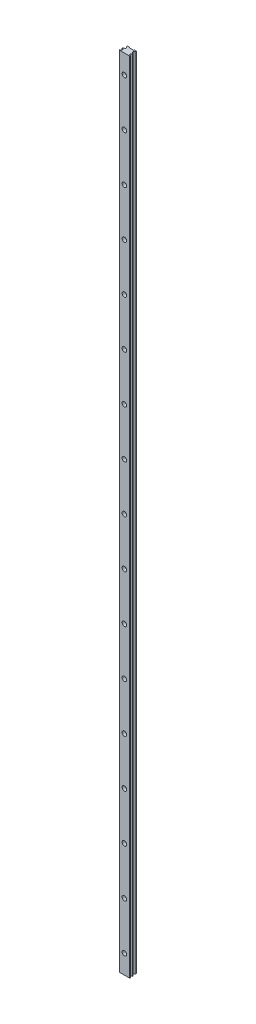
ISO-10303-21;
HEADER;
FILE_DESCRIPTION(('STEP AP214'),'2;1');
FILE_NAME('part.step','',(''),(''),'','','');
FILE_SCHEMA(('AUTOMOTIVE_DESIGN { 1 0 10303 214 1 1 1 1 }'));
ENDSEC;
DATA;
#1=APPLICATION_CONTEXT('core data for automotive mechanical design processes');
#2=APPLICATION_PROTOCOL_DEFINITION('international standard','automotive_design',2000,#1);
#3=PRODUCT_CONTEXT('',#1,'mechanical');
#4=PRODUCT('Part','Part','',(#3));
#5=PRODUCT_RELATED_PRODUCT_CATEGORY('part','',(#4));
#6=PRODUCT_DEFINITION_FORMATION('','',#4);
#7=PRODUCT_DEFINITION_CONTEXT('part definition',#1,'design');
#8=PRODUCT_DEFINITION('design','',#6,#7);
#9=PRODUCT_DEFINITION_SHAPE('','',#8);
#10=(LENGTH_UNIT() NAMED_UNIT(*) SI_UNIT(.MILLI.,.METRE.));
#11=(NAMED_UNIT(*) PLANE_ANGLE_UNIT() SI_UNIT($,.RADIAN.));
#12=(NAMED_UNIT(*) SI_UNIT($,.STERADIAN.) SOLID_ANGLE_UNIT());
#13=UNCERTAINTY_MEASURE_WITH_UNIT(LENGTH_MEASURE(1.E-05),#10,'distance_accuracy_value','');
#14=(GEOMETRIC_REPRESENTATION_CONTEXT(3) GLOBAL_UNCERTAINTY_ASSIGNED_CONTEXT((#13)) GLOBAL_UNIT_ASSIGNED_CONTEXT((#10,
#11,#12)) REPRESENTATION_CONTEXT('',''));
#15=CARTESIAN_POINT('',(0.,0.,0.));
#16=DIRECTION('',(0.,0.,1.));
#17=DIRECTION('',(1.,0.,0.));
#18=AXIS2_PLACEMENT_3D('',#15,#16,#17);
#19=CARTESIAN_POINT('',(0.,2050.,6.75));
#20=DIRECTION('',(0.,0.,1.));
#21=DIRECTION('',(0.,-1.,0.));
#22=AXIS2_PLACEMENT_3D('',#19,#20,#21);
#23=CYLINDRICAL_SURFACE('',#22,3.3);
#24=CARTESIAN_POINT('',(0.,2050.,1.49999999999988));
#25=DIRECTION('',(0.,0.,1.));
#26=DIRECTION('',(0.,-1.,0.));
#27=AXIS2_PLACEMENT_3D('',#24,#25,#26);
#28=CIRCLE('',#27,3.3);
#29=CARTESIAN_POINT('',(0.,2046.7,1.49999999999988));
#30=VERTEX_POINT('',#29);
#31=EDGE_CURVE('E266',#30,#30,#28,.T.);
#32=ORIENTED_EDGE('',*,*,#31,.F.);
#33=EDGE_LOOP('',(#32));
#34=FACE_BOUND('',#33,.T.);
#35=CARTESIAN_POINT('',(0.,2050.,12.));
#36=DIRECTION('',(0.,0.,1.));
#37=DIRECTION('',(0.,-1.,0.));
#38=AXIS2_PLACEMENT_3D('',#35,#36,#37);
#39=CIRCLE('',#38,3.3);
#40=CARTESIAN_POINT('',(0.,2046.7,12.));
#41=VERTEX_POINT('',#40);
#42=EDGE_CURVE('E18',#41,#41,#39,.T.);
#43=ORIENTED_EDGE('',*,*,#42,.T.);
#44=EDGE_LOOP('',(#43));
#45=FACE_BOUND('',#44,.T.);
#46=ADVANCED_FACE('F15',(#34,#45),#23,.F.);
#47=CARTESIAN_POINT('',(0.,1925.,6.75));
#48=DIRECTION('',(0.,0.,1.));
#49=DIRECTION('',(0.,-1.,0.));
#50=AXIS2_PLACEMENT_3D('',#47,#48,#49);
#51=CYLINDRICAL_SURFACE('',#50,3.3);
#52=CARTESIAN_POINT('',(0.,1925.,1.49999999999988));
#53=DIRECTION('',(0.,0.,1.));
#54=DIRECTION('',(0.,-1.,0.));
#55=AXIS2_PLACEMENT_3D('',#52,#53,#54);
#56=CIRCLE('',#55,3.3);
#57=CARTESIAN_POINT('',(0.,1921.7,1.49999999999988));
#58=VERTEX_POINT('',#57);
#59=EDGE_CURVE('E496',#58,#58,#56,.T.);
#60=ORIENTED_EDGE('',*,*,#59,.F.);
#61=EDGE_LOOP('',(#60));
#62=FACE_BOUND('',#61,.T.);
#63=CARTESIAN_POINT('',(0.,1925.,12.));
#64=DIRECTION('',(0.,0.,1.));
#65=DIRECTION('',(0.,-1.,0.));
#66=AXIS2_PLACEMENT_3D('',#63,#64,#65);
#67=CIRCLE('',#66,3.3);
#68=CARTESIAN_POINT('',(0.,1921.7,12.));
#69=VERTEX_POINT('',#68);
#70=EDGE_CURVE('E544',#69,#69,#67,.T.);
#71=ORIENTED_EDGE('',*,*,#70,.T.);
#72=EDGE_LOOP('',(#71));
#73=FACE_BOUND('',#72,.T.);
#74=ADVANCED_FACE('F751',(#62,#73),#51,.F.);
#75=CARTESIAN_POINT('',(0.,1800.,6.75));
#76=DIRECTION('',(0.,0.,1.));
#77=DIRECTION('',(0.,-1.,0.));
#78=AXIS2_PLACEMENT_3D('',#75,#76,#77);
#79=CYLINDRICAL_SURFACE('',#78,3.3);
#80=CARTESIAN_POINT('',(0.,1800.,1.49999999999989));
#81=DIRECTION('',(0.,0.,1.));
#82=DIRECTION('',(0.,-1.,0.));
#83=AXIS2_PLACEMENT_3D('',#80,#81,#82);
#84=CIRCLE('',#83,3.3);
#85=CARTESIAN_POINT('',(0.,1796.7,1.49999999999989));
#86=VERTEX_POINT('',#85);
#87=EDGE_CURVE('E493',#86,#86,#84,.T.);
#88=ORIENTED_EDGE('',*,*,#87,.F.);
#89=EDGE_LOOP('',(#88));
#90=FACE_BOUND('',#89,.T.);
#91=CARTESIAN_POINT('',(0.,1800.,12.));
#92=DIRECTION('',(0.,0.,1.));
#93=DIRECTION('',(0.,-1.,0.));
#94=AXIS2_PLACEMENT_3D('',#91,#92,#93);
#95=CIRCLE('',#94,3.3);
#96=CARTESIAN_POINT('',(0.,1796.7,12.));
#97=VERTEX_POINT('',#96);
#98=EDGE_CURVE('E542',#97,#97,#95,.T.);
#99=ORIENTED_EDGE('',*,*,#98,.T.);
#100=EDGE_LOOP('',(#99));
#101=FACE_BOUND('',#100,.T.);
#102=ADVANCED_FACE('F748',(#90,#101),#79,.F.);
#103=CARTESIAN_POINT('',(0.,1675.,6.75));
#104=DIRECTION('',(0.,0.,1.));
#105=DIRECTION('',(0.,-1.,0.));
#106=AXIS2_PLACEMENT_3D('',#103,#104,#105);
#107=CYLINDRICAL_SURFACE('',#106,3.3);
#108=CARTESIAN_POINT('',(0.,1675.,1.4999999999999));
#109=DIRECTION('',(0.,0.,1.));
#110=DIRECTION('',(0.,-1.,0.));
#111=AXIS2_PLACEMENT_3D('',#108,#109,#110);
#112=CIRCLE('',#111,3.3);
#113=CARTESIAN_POINT('',(0.,1671.7,1.4999999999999));
#114=VERTEX_POINT('',#113);
#115=EDGE_CURVE('E490',#114,#114,#112,.T.);
#116=ORIENTED_EDGE('',*,*,#115,.F.);
#117=EDGE_LOOP('',(#116));
#118=FACE_BOUND('',#117,.T.);
#119=CARTESIAN_POINT('',(0.,1675.,12.));
#120=DIRECTION('',(0.,0.,1.));
#121=DIRECTION('',(0.,-1.,0.));
#122=AXIS2_PLACEMENT_3D('',#119,#120,#121);
#123=CIRCLE('',#122,3.3);
#124=CARTESIAN_POINT('',(0.,1671.7,12.));
#125=VERTEX_POINT('',#124);
#126=EDGE_CURVE('E539',#125,#125,#123,.T.);
#127=ORIENTED_EDGE('',*,*,#126,.T.);
#128=EDGE_LOOP('',(#127));
#129=FACE_BOUND('',#128,.T.);
#130=ADVANCED_FACE('F744',(#118,#129),#107,.F.);
#131=CARTESIAN_POINT('',(0.,1550.,6.75));
#132=DIRECTION('',(0.,0.,1.));
#133=DIRECTION('',(0.,-1.,0.));
#134=AXIS2_PLACEMENT_3D('',#131,#132,#133);
#135=CYLINDRICAL_SURFACE('',#134,3.3);
#136=CARTESIAN_POINT('',(0.,1550.,1.49999999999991));
#137=DIRECTION('',(0.,0.,1.));
#138=DIRECTION('',(0.,-1.,0.));
#139=AXIS2_PLACEMENT_3D('',#136,#137,#138);
#140=CIRCLE('',#139,3.3);
#141=CARTESIAN_POINT('',(0.,1546.7,1.49999999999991));
#142=VERTEX_POINT('',#141);
#143=EDGE_CURVE('E487',#142,#142,#140,.T.);
#144=ORIENTED_EDGE('',*,*,#143,.F.);
#145=EDGE_LOOP('',(#144));
#146=FACE_BOUND('',#145,.T.);
#147=CARTESIAN_POINT('',(0.,1550.,12.));
#148=DIRECTION('',(0.,0.,1.));
#149=DIRECTION('',(0.,-1.,0.));
#150=AXIS2_PLACEMENT_3D('',#147,#148,#149);
#151=CIRCLE('',#150,3.3);
#152=CARTESIAN_POINT('',(0.,1546.7,12.));
#153=VERTEX_POINT('',#152);
#154=EDGE_CURVE('E536',#153,#153,#151,.T.);
#155=ORIENTED_EDGE('',*,*,#154,.T.);
#156=EDGE_LOOP('',(#155));
#157=FACE_BOUND('',#156,.T.);
#158=ADVANCED_FACE('F740',(#146,#157),#135,.F.);
#159=CARTESIAN_POINT('',(0.,1425.,6.75));
#160=DIRECTION('',(0.,0.,1.));
#161=DIRECTION('',(0.,-1.,0.));
#162=AXIS2_PLACEMENT_3D('',#159,#160,#161);
#163=CYLINDRICAL_SURFACE('',#162,3.3);
#164=CARTESIAN_POINT('',(0.,1425.,1.49999999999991));
#165=DIRECTION('',(0.,0.,1.));
#166=DIRECTION('',(0.,-1.,0.));
#167=AXIS2_PLACEMENT_3D('',#164,#165,#166);
#168=CIRCLE('',#167,3.3);
#169=CARTESIAN_POINT('',(0.,1421.7,1.49999999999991));
#170=VERTEX_POINT('',#169);
#171=EDGE_CURVE('E484',#170,#170,#168,.T.);
#172=ORIENTED_EDGE('',*,*,#171,.F.);
#173=EDGE_LOOP('',(#172));
#174=FACE_BOUND('',#173,.T.);
#175=CARTESIAN_POINT('',(0.,1425.,12.));
#176=DIRECTION('',(0.,0.,1.));
#177=DIRECTION('',(0.,-1.,0.));
#178=AXIS2_PLACEMENT_3D('',#175,#176,#177);
#179=CIRCLE('',#178,3.3);
#180=CARTESIAN_POINT('',(0.,1421.7,12.));
#181=VERTEX_POINT('',#180);
#182=EDGE_CURVE('E533',#181,#181,#179,.T.);
#183=ORIENTED_EDGE('',*,*,#182,.T.);
#184=EDGE_LOOP('',(#183));
#185=FACE_BOUND('',#184,.T.);
#186=ADVANCED_FACE('F736',(#174,#185),#163,.F.);
#187=CARTESIAN_POINT('',(0.,1300.,6.75));
#188=DIRECTION('',(0.,0.,1.));
#189=DIRECTION('',(0.,-1.,0.));
#190=AXIS2_PLACEMENT_3D('',#187,#188,#189);
#191=CYLINDRICAL_SURFACE('',#190,3.3);
#192=CARTESIAN_POINT('',(0.,1300.,1.49999999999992));
#193=DIRECTION('',(0.,0.,1.));
#194=DIRECTION('',(0.,-1.,0.));
#195=AXIS2_PLACEMENT_3D('',#192,#193,#194);
#196=CIRCLE('',#195,3.3);
#197=CARTESIAN_POINT('',(0.,1296.7,1.49999999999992));
#198=VERTEX_POINT('',#197);
#199=EDGE_CURVE('E481',#198,#198,#196,.T.);
#200=ORIENTED_EDGE('',*,*,#199,.F.);
#201=EDGE_LOOP('',(#200));
#202=FACE_BOUND('',#201,.T.);
#203=CARTESIAN_POINT('',(0.,1300.,12.));
#204=DIRECTION('',(0.,0.,1.));
#205=DIRECTION('',(0.,-1.,0.));
#206=AXIS2_PLACEMENT_3D('',#203,#204,#205);
#207=CIRCLE('',#206,3.3);
#208=CARTESIAN_POINT('',(0.,1296.7,12.));
#209=VERTEX_POINT('',#208);
#210=EDGE_CURVE('E530',#209,#209,#207,.T.);
#211=ORIENTED_EDGE('',*,*,#210,.T.);
#212=EDGE_LOOP('',(#211));
#213=FACE_BOUND('',#212,.T.);
#214=ADVANCED_FACE('F732',(#202,#213),#191,.F.);
#215=CARTESIAN_POINT('',(0.,1175.,6.75));
#216=DIRECTION('',(0.,0.,1.));
#217=DIRECTION('',(0.,-1.,0.));
#218=AXIS2_PLACEMENT_3D('',#215,#216,#217);
#219=CYLINDRICAL_SURFACE('',#218,3.3);
#220=CARTESIAN_POINT('',(0.,1175.,1.49999999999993));
#221=DIRECTION('',(0.,0.,1.));
#222=DIRECTION('',(0.,-1.,0.));
#223=AXIS2_PLACEMENT_3D('',#220,#221,#222);
#224=CIRCLE('',#223,3.3);
#225=CARTESIAN_POINT('',(0.,1171.7,1.49999999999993));
#226=VERTEX_POINT('',#225);
#227=EDGE_CURVE('E478',#226,#226,#224,.T.);
#228=ORIENTED_EDGE('',*,*,#227,.F.);
#229=EDGE_LOOP('',(#228));
#230=FACE_BOUND('',#229,.T.);
#231=CARTESIAN_POINT('',(0.,1175.,12.));
#232=DIRECTION('',(0.,0.,1.));
#233=DIRECTION('',(0.,-1.,0.));
#234=AXIS2_PLACEMENT_3D('',#231,#232,#233);
#235=CIRCLE('',#234,3.3);
#236=CARTESIAN_POINT('',(0.,1171.7,12.));
#237=VERTEX_POINT('',#236);
#238=EDGE_CURVE('E527',#237,#237,#235,.T.);
#239=ORIENTED_EDGE('',*,*,#238,.T.);
#240=EDGE_LOOP('',(#239));
#241=FACE_BOUND('',#240,.T.);
#242=ADVANCED_FACE('F728',(#230,#241),#219,.F.);
#243=CARTESIAN_POINT('',(0.,1050.,6.75));
#244=DIRECTION('',(0.,0.,1.));
#245=DIRECTION('',(0.,-1.,0.));
#246=AXIS2_PLACEMENT_3D('',#243,#244,#245);
#247=CYLINDRICAL_SURFACE('',#246,3.3);
#248=CARTESIAN_POINT('',(0.,1050.,1.49999999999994));
#249=DIRECTION('',(0.,0.,1.));
#250=DIRECTION('',(0.,-1.,0.));
#251=AXIS2_PLACEMENT_3D('',#248,#249,#250);
#252=CIRCLE('',#251,3.3);
#253=CARTESIAN_POINT('',(0.,1046.7,1.49999999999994));
#254=VERTEX_POINT('',#253);
#255=EDGE_CURVE('E475',#254,#254,#252,.T.);
#256=ORIENTED_EDGE('',*,*,#255,.F.);
#257=EDGE_LOOP('',(#256));
#258=FACE_BOUND('',#257,.T.);
#259=CARTESIAN_POINT('',(0.,1050.,12.));
#260=DIRECTION('',(0.,0.,1.));
#261=DIRECTION('',(0.,-1.,0.));
#262=AXIS2_PLACEMENT_3D('',#259,#260,#261);
#263=CIRCLE('',#262,3.3);
#264=CARTESIAN_POINT('',(0.,1046.7,12.));
#265=VERTEX_POINT('',#264);
#266=EDGE_CURVE('E524',#265,#265,#263,.T.);
#267=ORIENTED_EDGE('',*,*,#266,.T.);
#268=EDGE_LOOP('',(#267));
#269=FACE_BOUND('',#268,.T.);
#270=ADVANCED_FACE('F724',(#258,#269),#247,.F.);
#271=CARTESIAN_POINT('',(0.,925.,6.75));
#272=DIRECTION('',(0.,0.,1.));
#273=DIRECTION('',(0.,-1.,0.));
#274=AXIS2_PLACEMENT_3D('',#271,#272,#273);
#275=CYLINDRICAL_SURFACE('',#274,3.3);
#276=CARTESIAN_POINT('',(0.,925.,1.49999999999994));
#277=DIRECTION('',(0.,0.,1.));
#278=DIRECTION('',(0.,-1.,0.));
#279=AXIS2_PLACEMENT_3D('',#276,#277,#278);
#280=CIRCLE('',#279,3.3);
#281=CARTESIAN_POINT('',(0.,921.7,1.49999999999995));
#282=VERTEX_POINT('',#281);
#283=EDGE_CURVE('E472',#282,#282,#280,.T.);
#284=ORIENTED_EDGE('',*,*,#283,.F.);
#285=EDGE_LOOP('',(#284));
#286=FACE_BOUND('',#285,.T.);
#287=CARTESIAN_POINT('',(0.,925.,12.));
#288=DIRECTION('',(0.,0.,1.));
#289=DIRECTION('',(0.,-1.,0.));
#290=AXIS2_PLACEMENT_3D('',#287,#288,#289);
#291=CIRCLE('',#290,3.3);
#292=CARTESIAN_POINT('',(0.,921.7,12.));
#293=VERTEX_POINT('',#292);
#294=EDGE_CURVE('E521',#293,#293,#291,.T.);
#295=ORIENTED_EDGE('',*,*,#294,.T.);
#296=EDGE_LOOP('',(#295));
#297=FACE_BOUND('',#296,.T.);
#298=ADVANCED_FACE('F720',(#286,#297),#275,.F.);
#299=CARTESIAN_POINT('',(0.,800.,6.75));
#300=DIRECTION('',(0.,0.,1.));
#301=DIRECTION('',(0.,-1.,0.));
#302=AXIS2_PLACEMENT_3D('',#299,#300,#301);
#303=CYLINDRICAL_SURFACE('',#302,3.3);
#304=CARTESIAN_POINT('',(0.,800.,1.49999999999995));
#305=DIRECTION('',(0.,0.,1.));
#306=DIRECTION('',(0.,-1.,0.));
#307=AXIS2_PLACEMENT_3D('',#304,#305,#306);
#308=CIRCLE('',#307,3.3);
#309=CARTESIAN_POINT('',(0.,796.7,1.49999999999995));
#310=VERTEX_POINT('',#309);
#311=EDGE_CURVE('E469',#310,#310,#308,.T.);
#312=ORIENTED_EDGE('',*,*,#311,.F.);
#313=EDGE_LOOP('',(#312));
#314=FACE_BOUND('',#313,.T.);
#315=CARTESIAN_POINT('',(0.,800.,12.));
#316=DIRECTION('',(0.,0.,1.));
#317=DIRECTION('',(0.,-1.,0.));
#318=AXIS2_PLACEMENT_3D('',#315,#316,#317);
#319=CIRCLE('',#318,3.3);
#320=CARTESIAN_POINT('',(0.,796.7,12.));
#321=VERTEX_POINT('',#320);
#322=EDGE_CURVE('E518',#321,#321,#319,.T.);
#323=ORIENTED_EDGE('',*,*,#322,.T.);
#324=EDGE_LOOP('',(#323));
#325=FACE_BOUND('',#324,.T.);
#326=ADVANCED_FACE('F716',(#314,#325),#303,.F.);
#327=CARTESIAN_POINT('',(0.,675.,6.75));
#328=DIRECTION('',(0.,0.,1.));
#329=DIRECTION('',(0.,-1.,0.));
#330=AXIS2_PLACEMENT_3D('',#327,#328,#329);
#331=CYLINDRICAL_SURFACE('',#330,3.3);
#332=CARTESIAN_POINT('',(0.,675.,1.49999999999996));
#333=DIRECTION('',(0.,0.,1.));
#334=DIRECTION('',(0.,-1.,0.));
#335=AXIS2_PLACEMENT_3D('',#332,#333,#334);
#336=CIRCLE('',#335,3.3);
#337=CARTESIAN_POINT('',(0.,671.7,1.49999999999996));
#338=VERTEX_POINT('',#337);
#339=EDGE_CURVE('E466',#338,#338,#336,.T.);
#340=ORIENTED_EDGE('',*,*,#339,.F.);
#341=EDGE_LOOP('',(#340));
#342=FACE_BOUND('',#341,.T.);
#343=CARTESIAN_POINT('',(0.,675.,12.));
#344=DIRECTION('',(0.,0.,1.));
#345=DIRECTION('',(0.,-1.,0.));
#346=AXIS2_PLACEMENT_3D('',#343,#344,#345);
#347=CIRCLE('',#346,3.3);
#348=CARTESIAN_POINT('',(0.,671.7,12.));
#349=VERTEX_POINT('',#348);
#350=EDGE_CURVE('E515',#349,#349,#347,.T.);
#351=ORIENTED_EDGE('',*,*,#350,.T.);
#352=EDGE_LOOP('',(#351));
#353=FACE_BOUND('',#352,.T.);
#354=ADVANCED_FACE('F712',(#342,#353),#331,.F.);
#355=CARTESIAN_POINT('',(0.,550.,6.75));
#356=DIRECTION('',(0.,0.,1.));
#357=DIRECTION('',(0.,-1.,0.));
#358=AXIS2_PLACEMENT_3D('',#355,#356,#357);
#359=CYLINDRICAL_SURFACE('',#358,3.3);
#360=CARTESIAN_POINT('',(0.,550.,1.49999999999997));
#361=DIRECTION('',(0.,0.,1.));
#362=DIRECTION('',(0.,-1.,0.));
#363=AXIS2_PLACEMENT_3D('',#360,#361,#362);
#364=CIRCLE('',#363,3.3);
#365=CARTESIAN_POINT('',(0.,546.7,1.49999999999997));
#366=VERTEX_POINT('',#365);
#367=EDGE_CURVE('E463',#366,#366,#364,.T.);
#368=ORIENTED_EDGE('',*,*,#367,.F.);
#369=EDGE_LOOP('',(#368));
#370=FACE_BOUND('',#369,.T.);
#371=CARTESIAN_POINT('',(0.,550.,12.));
#372=DIRECTION('',(0.,0.,1.));
#373=DIRECTION('',(0.,-1.,0.));
#374=AXIS2_PLACEMENT_3D('',#371,#372,#373);
#375=CIRCLE('',#374,3.3);
#376=CARTESIAN_POINT('',(0.,546.7,12.));
#377=VERTEX_POINT('',#376);
#378=EDGE_CURVE('E512',#377,#377,#375,.T.);
#379=ORIENTED_EDGE('',*,*,#378,.T.);
#380=EDGE_LOOP('',(#379));
#381=FACE_BOUND('',#380,.T.);
#382=ADVANCED_FACE('F708',(#370,#381),#359,.F.);
#383=CARTESIAN_POINT('',(0.,425.,6.75));
#384=DIRECTION('',(0.,0.,1.));
#385=DIRECTION('',(0.,-1.,0.));
#386=AXIS2_PLACEMENT_3D('',#383,#384,#385);
#387=CYLINDRICAL_SURFACE('',#386,3.3);
#388=CARTESIAN_POINT('',(0.,425.,1.49999999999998));
#389=DIRECTION('',(0.,0.,1.));
#390=DIRECTION('',(0.,-1.,0.));
#391=AXIS2_PLACEMENT_3D('',#388,#389,#390);
#392=CIRCLE('',#391,3.3);
#393=CARTESIAN_POINT('',(0.,421.7,1.49999999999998));
#394=VERTEX_POINT('',#393);
#395=EDGE_CURVE('E460',#394,#394,#392,.T.);
#396=ORIENTED_EDGE('',*,*,#395,.F.);
#397=EDGE_LOOP('',(#396));
#398=FACE_BOUND('',#397,.T.);
#399=CARTESIAN_POINT('',(0.,425.,12.));
#400=DIRECTION('',(0.,0.,1.));
#401=DIRECTION('',(0.,-1.,0.));
#402=AXIS2_PLACEMENT_3D('',#399,#400,#401);
#403=CIRCLE('',#402,3.3);
#404=CARTESIAN_POINT('',(0.,421.7,12.));
#405=VERTEX_POINT('',#404);
#406=EDGE_CURVE('E509',#405,#405,#403,.T.);
#407=ORIENTED_EDGE('',*,*,#406,.T.);
#408=EDGE_LOOP('',(#407));
#409=FACE_BOUND('',#408,.T.);
#410=ADVANCED_FACE('F704',(#398,#409),#387,.F.);
#411=CARTESIAN_POINT('',(0.,300.,6.75));
#412=DIRECTION('',(0.,0.,1.));
#413=DIRECTION('',(0.,-1.,0.));
#414=AXIS2_PLACEMENT_3D('',#411,#412,#413);
#415=CYLINDRICAL_SURFACE('',#414,3.3);
#416=CARTESIAN_POINT('',(0.,300.,1.49999999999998));
#417=DIRECTION('',(0.,0.,1.));
#418=DIRECTION('',(0.,-1.,0.));
#419=AXIS2_PLACEMENT_3D('',#416,#417,#418);
#420=CIRCLE('',#419,3.3);
#421=CARTESIAN_POINT('',(0.,296.7,1.49999999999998));
#422=VERTEX_POINT('',#421);
#423=EDGE_CURVE('E457',#422,#422,#420,.T.);
#424=ORIENTED_EDGE('',*,*,#423,.F.);
#425=EDGE_LOOP('',(#424));
#426=FACE_BOUND('',#425,.T.);
#427=CARTESIAN_POINT('',(0.,300.,12.));
#428=DIRECTION('',(0.,0.,1.));
#429=DIRECTION('',(0.,-1.,0.));
#430=AXIS2_PLACEMENT_3D('',#427,#428,#429);
#431=CIRCLE('',#430,3.3);
#432=CARTESIAN_POINT('',(0.,296.7,12.));
#433=VERTEX_POINT('',#432);
#434=EDGE_CURVE('E506',#433,#433,#431,.T.);
#435=ORIENTED_EDGE('',*,*,#434,.T.);
#436=EDGE_LOOP('',(#435));
#437=FACE_BOUND('',#436,.T.);
#438=ADVANCED_FACE('F700',(#426,#437),#415,.F.);
#439=CARTESIAN_POINT('',(0.,175.,6.75));
#440=DIRECTION('',(0.,0.,1.));
#441=DIRECTION('',(0.,-1.,0.));
#442=AXIS2_PLACEMENT_3D('',#439,#440,#441);
#443=CYLINDRICAL_SURFACE('',#442,3.3);
#444=CARTESIAN_POINT('',(0.,175.,1.49999999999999));
#445=DIRECTION('',(0.,0.,1.));
#446=DIRECTION('',(0.,-1.,0.));
#447=AXIS2_PLACEMENT_3D('',#444,#445,#446);
#448=CIRCLE('',#447,3.3);
#449=CARTESIAN_POINT('',(0.,171.7,1.49999999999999));
#450=VERTEX_POINT('',#449);
#451=EDGE_CURVE('E454',#450,#450,#448,.T.);
#452=ORIENTED_EDGE('',*,*,#451,.F.);
#453=EDGE_LOOP('',(#452));
#454=FACE_BOUND('',#453,.T.);
#455=CARTESIAN_POINT('',(0.,175.,12.));
#456=DIRECTION('',(0.,0.,1.));
#457=DIRECTION('',(0.,-1.,0.));
#458=AXIS2_PLACEMENT_3D('',#455,#456,#457);
#459=CIRCLE('',#458,3.3);
#460=CARTESIAN_POINT('',(0.,171.7,12.));
#461=VERTEX_POINT('',#460);
#462=EDGE_CURVE('E503',#461,#461,#459,.T.);
#463=ORIENTED_EDGE('',*,*,#462,.T.);
#464=EDGE_LOOP('',(#463));
#465=FACE_BOUND('',#464,.T.);
#466=ADVANCED_FACE('F696',(#454,#465),#443,.F.);
#467=CARTESIAN_POINT('',(0.,50.,6.75));
#468=DIRECTION('',(0.,0.,1.));
#469=DIRECTION('',(0.,-1.,0.));
#470=AXIS2_PLACEMENT_3D('',#467,#468,#469);
#471=CYLINDRICAL_SURFACE('',#470,3.3);
#472=CARTESIAN_POINT('',(0.,50.,1.5));
#473=DIRECTION('',(0.,0.,1.));
#474=DIRECTION('',(0.,-1.,0.));
#475=AXIS2_PLACEMENT_3D('',#472,#473,#474);
#476=CIRCLE('',#475,3.3);
#477=CARTESIAN_POINT('',(0.,46.7,1.5));
#478=VERTEX_POINT('',#477);
#479=EDGE_CURVE('E262',#478,#478,#476,.T.);
#480=ORIENTED_EDGE('',*,*,#479,.F.);
#481=EDGE_LOOP('',(#480));
#482=FACE_BOUND('',#481,.T.);
#483=CARTESIAN_POINT('',(0.,50.,12.));
#484=DIRECTION('',(0.,0.,1.));
#485=DIRECTION('',(0.,-1.,0.));
#486=AXIS2_PLACEMENT_3D('',#483,#484,#485);
#487=CIRCLE('',#486,3.3);
#488=CARTESIAN_POINT('',(0.,46.7,12.));
#489=VERTEX_POINT('',#488);
#490=EDGE_CURVE('E285',#489,#489,#487,.T.);
#491=ORIENTED_EDGE('',*,*,#490,.T.);
#492=EDGE_LOOP('',(#491));
#493=FACE_BOUND('',#492,.T.);
#494=ADVANCED_FACE('F692',(#482,#493),#471,.F.);
#495=CARTESIAN_POINT('',(-6.,0.,0.750000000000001));
#496=DIRECTION('',(1.,0.,0.));
#497=DIRECTION('',(0.,0.,-1.));
#498=AXIS2_PLACEMENT_3D('',#495,#496,#497);
#499=PLANE('',#498);
#500=DIRECTION('',(0.,0.,-1.));
#501=VECTOR('',#500,1.);
#502=CARTESIAN_POINT('',(-6.,0.,0.750000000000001));
#503=LINE('',#502,#501);
#504=CARTESIAN_POINT('',(-6.,0.,1.49999999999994));
#505=VERTEX_POINT('',#504);
#506=CARTESIAN_POINT('',(-6.,0.,0.));
#507=VERTEX_POINT('',#506);
#508=EDGE_CURVE('E307',#505,#507,#503,.T.);
#509=ORIENTED_EDGE('',*,*,#508,.T.);
#510=DIRECTION('',(0.,1.,0.));
#511=VECTOR('',#510,1.);
#512=CARTESIAN_POINT('',(-6.,0.,0.));
#513=LINE('',#512,#511);
#514=CARTESIAN_POINT('',(-6.,2100.,0.));
#515=VERTEX_POINT('',#514);
#516=EDGE_CURVE('E263',#515,#507,#513,.F.);
#517=ORIENTED_EDGE('',*,*,#516,.F.);
#518=DIRECTION('',(0.,0.,-1.));
#519=VECTOR('',#518,1.);
#520=CARTESIAN_POINT('',(-6.,2100.,0.750000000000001));
#521=LINE('',#520,#519);
#522=CARTESIAN_POINT('',(-6.,2100.,1.49999999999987));
#523=VERTEX_POINT('',#522);
#524=EDGE_CURVE('E309',#515,#523,#521,.F.);
#525=ORIENTED_EDGE('',*,*,#524,.T.);
#526=DIRECTION('',(0.,1.,0.));
#527=VECTOR('',#526,1.);
#528=CARTESIAN_POINT('',(-6.,0.,1.5));
#529=LINE('',#528,#527);
#530=EDGE_CURVE('E256',#505,#523,#529,.T.);
#531=ORIENTED_EDGE('',*,*,#530,.F.);
#532=EDGE_LOOP('',(#509,#517,#525,#531));
#533=FACE_BOUND('',#532,.T.);
#534=ADVANCED_FACE('F688',(#533),#499,.T.);
#535=CARTESIAN_POINT('',(6.,0.,0.750000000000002));
#536=DIRECTION('',(-1.,0.,0.));
#537=DIRECTION('',(0.,0.,1.));
#538=AXIS2_PLACEMENT_3D('',#535,#536,#537);
#539=PLANE('',#538);
#540=DIRECTION('',(0.,0.,1.));
#541=VECTOR('',#540,1.);
#542=CARTESIAN_POINT('',(6.,0.,0.750000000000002));
#543=LINE('',#542,#541);
#544=CARTESIAN_POINT('',(6.,0.,0.));
#545=VERTEX_POINT('',#544);
#546=CARTESIAN_POINT('',(6.,0.,1.5));
#547=VERTEX_POINT('',#546);
#548=EDGE_CURVE('E301',#545,#547,#543,.T.);
#549=ORIENTED_EDGE('',*,*,#548,.T.);
#550=DIRECTION('',(0.,1.,0.));
#551=VECTOR('',#550,1.);
#552=CARTESIAN_POINT('',(6.,0.,1.5));
#553=LINE('',#552,#551);
#554=CARTESIAN_POINT('',(6.,2100.,1.49999999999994));
#555=VERTEX_POINT('',#554);
#556=EDGE_CURVE('E259',#555,#547,#553,.F.);
#557=ORIENTED_EDGE('',*,*,#556,.F.);
#558=DIRECTION('',(0.,0.,1.));
#559=VECTOR('',#558,1.);
#560=CARTESIAN_POINT('',(6.,2100.,0.750000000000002));
#561=LINE('',#560,#559);
#562=CARTESIAN_POINT('',(6.,2100.,-1.26726237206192E-13));
#563=VERTEX_POINT('',#562);
#564=EDGE_CURVE('E305',#555,#563,#561,.F.);
#565=ORIENTED_EDGE('',*,*,#564,.T.);
#566=DIRECTION('',(0.,1.,0.));
#567=VECTOR('',#566,1.);
#568=CARTESIAN_POINT('',(6.,0.,0.));
#569=LINE('',#568,#567);
#570=EDGE_CURVE('E253',#545,#563,#569,.T.);
#571=ORIENTED_EDGE('',*,*,#570,.F.);
#572=EDGE_LOOP('',(#549,#557,#565,#571));
#573=FACE_BOUND('',#572,.T.);
#574=ADVANCED_FACE('F685',(#573),#539,.T.);
#575=CARTESIAN_POINT('',(14.,0.,11.58578644));
#576=DIRECTION('',(1.,0.,0.));
#577=DIRECTION('',(0.,0.,-1.));
#578=AXIS2_PLACEMENT_3D('',#575,#576,#577);
#579=PLANE('',#578);
#580=DIRECTION('',(0.,0.,-1.));
#581=VECTOR('',#580,1.);
#582=CARTESIAN_POINT('',(14.,0.,11.58578644));
#583=LINE('',#582,#581);
#584=CARTESIAN_POINT('',(14.,0.,12.17157288));
#585=VERTEX_POINT('',#584);
#586=CARTESIAN_POINT('',(14.,0.,11.));
#587=VERTEX_POINT('',#586);
#588=EDGE_CURVE('E291',#585,#587,#583,.T.);
#589=ORIENTED_EDGE('',*,*,#588,.T.);
#590=DIRECTION('',(0.,1.,0.));
#591=VECTOR('',#590,1.);
#592=CARTESIAN_POINT('',(13.9999999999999,0.,11.));
#593=LINE('',#592,#591);
#594=CARTESIAN_POINT('',(14.,2100.,10.9999999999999));
#595=VERTEX_POINT('',#594);
#596=EDGE_CURVE('E243',#595,#587,#593,.F.);
#597=ORIENTED_EDGE('',*,*,#596,.F.);
#598=DIRECTION('',(0.,0.,-1.));
#599=VECTOR('',#598,1.);
#600=CARTESIAN_POINT('',(14.,2100.,11.58578644));
#601=LINE('',#600,#599);
#602=CARTESIAN_POINT('',(14.,2100.,12.1715728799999));
#603=VERTEX_POINT('',#602);
#604=EDGE_CURVE('E161',#595,#603,#601,.F.);
#605=ORIENTED_EDGE('',*,*,#604,.T.);
#606=DIRECTION('',(0.,1.,0.));
#607=VECTOR('',#606,1.);
#608=CARTESIAN_POINT('',(14.,0.,12.17157288));
#609=LINE('',#608,#607);
#610=EDGE_CURVE('E172',#585,#603,#609,.T.);
#611=ORIENTED_EDGE('',*,*,#610,.F.);
#612=EDGE_LOOP('',(#589,#597,#605,#611));
#613=FACE_BOUND('',#612,.T.);
#614=ADVANCED_FACE('F681',(#613),#579,.T.);
#615=CARTESIAN_POINT('',(-14.,0.,11.58578644));
#616=DIRECTION('',(-1.,0.,0.));
#617=DIRECTION('',(0.,0.,1.));
#618=AXIS2_PLACEMENT_3D('',#615,#616,#617);
#619=PLANE('',#618);
#620=DIRECTION('',(0.,0.,1.));
#621=VECTOR('',#620,1.);
#622=CARTESIAN_POINT('',(-14.,0.,11.58578644));
#623=LINE('',#622,#621);
#624=CARTESIAN_POINT('',(-14.,0.,10.9999999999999));
#625=VERTEX_POINT('',#624);
#626=CARTESIAN_POINT('',(-14.,0.,12.17157288));
#627=VERTEX_POINT('',#626);
#628=EDGE_CURVE('E290',#625,#627,#623,.T.);
#629=ORIENTED_EDGE('',*,*,#628,.T.);
#630=DIRECTION('',(0.,1.,0.));
#631=VECTOR('',#630,1.);
#632=CARTESIAN_POINT('',(-14.,0.,12.17157288));
#633=LINE('',#632,#631);
#634=CARTESIAN_POINT('',(-14.,2100.,12.1715728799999));
#635=VERTEX_POINT('',#634);
#636=EDGE_CURVE('E225',#635,#627,#633,.F.);
#637=ORIENTED_EDGE('',*,*,#636,.F.);
#638=DIRECTION('',(0.,0.,1.));
#639=VECTOR('',#638,1.);
#640=CARTESIAN_POINT('',(-14.,2100.,11.58578644));
#641=LINE('',#640,#639);
#642=CARTESIAN_POINT('',(-14.,2100.,10.9999999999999));
#643=VERTEX_POINT('',#642);
#644=EDGE_CURVE('E288',#635,#643,#641,.F.);
#645=ORIENTED_EDGE('',*,*,#644,.T.);
#646=DIRECTION('',(0.,1.,0.));
#647=VECTOR('',#646,1.);
#648=CARTESIAN_POINT('',(-14.,0.,11.));
#649=LINE('',#648,#647);
#650=EDGE_CURVE('E224',#625,#643,#649,.T.);
#651=ORIENTED_EDGE('',*,*,#650,.F.);
#652=EDGE_LOOP('',(#629,#637,#645,#651));
#653=FACE_BOUND('',#652,.T.);
#654=ADVANCED_FACE('F556',(#653),#619,.T.);
#655=CARTESIAN_POINT('',(4.65,2050.,12.));
#656=DIRECTION('',(0.,0.,-1.));
#657=DIRECTION('',(0.,1.,0.));
#658=AXIS2_PLACEMENT_3D('',#655,#656,#657);
#659=PLANE('',#658);
#660=ORIENTED_EDGE('',*,*,#42,.F.);
#661=EDGE_LOOP('',(#660));
#662=FACE_BOUND('',#661,.T.);
#663=CARTESIAN_POINT('',(0.,2050.,12.));
#664=DIRECTION('',(0.,0.,1.));
#665=DIRECTION('',(0.,-1.,0.));
#666=AXIS2_PLACEMENT_3D('',#663,#664,#665);
#667=CIRCLE('',#666,6.);
#668=CARTESIAN_POINT('',(0.,2044.,12.));
#669=VERTEX_POINT('',#668);
#670=EDGE_CURVE('E184',#669,#669,#667,.T.);
#671=ORIENTED_EDGE('',*,*,#670,.T.);
#672=EDGE_LOOP('',(#671));
#673=FACE_BOUND('',#672,.T.);
#674=ADVANCED_FACE('F552',(#662,#673),#659,.F.);
#675=CARTESIAN_POINT('',(4.65,1925.,12.));
#676=DIRECTION('',(0.,0.,-1.));
#677=DIRECTION('',(0.,1.,0.));
#678=AXIS2_PLACEMENT_3D('',#675,#676,#677);
#679=PLANE('',#678);
#680=ORIENTED_EDGE('',*,*,#70,.F.);
#681=EDGE_LOOP('',(#680));
#682=FACE_BOUND('',#681,.T.);
#683=CARTESIAN_POINT('',(0.,1925.,12.));
#684=DIRECTION('',(0.,0.,1.));
#685=DIRECTION('',(0.,-1.,0.));
#686=AXIS2_PLACEMENT_3D('',#683,#684,#685);
#687=CIRCLE('',#686,6.);
#688=CARTESIAN_POINT('',(0.,1919.,12.));
#689=VERTEX_POINT('',#688);
#690=EDGE_CURVE('E447',#689,#689,#687,.T.);
#691=ORIENTED_EDGE('',*,*,#690,.T.);
#692=EDGE_LOOP('',(#691));
#693=FACE_BOUND('',#692,.T.);
#694=ADVANCED_FACE('F555',(#682,#693),#679,.F.);
#695=CARTESIAN_POINT('',(4.65,1800.,12.));
#696=DIRECTION('',(0.,0.,-1.));
#697=DIRECTION('',(0.,1.,0.));
#698=AXIS2_PLACEMENT_3D('',#695,#696,#697);
#699=PLANE('',#698);
#700=ORIENTED_EDGE('',*,*,#98,.F.);
#701=EDGE_LOOP('',(#700));
#702=FACE_BOUND('',#701,.T.);
#703=CARTESIAN_POINT('',(0.,1800.,12.));
#704=DIRECTION('',(0.,0.,1.));
#705=DIRECTION('',(0.,-1.,0.));
#706=AXIS2_PLACEMENT_3D('',#703,#704,#705);
#707=CIRCLE('',#706,6.);
#708=CARTESIAN_POINT('',(0.,1794.,12.));
#709=VERTEX_POINT('',#708);
#710=EDGE_CURVE('E444',#709,#709,#707,.T.);
#711=ORIENTED_EDGE('',*,*,#710,.T.);
#712=EDGE_LOOP('',(#711));
#713=FACE_BOUND('',#712,.T.);
#714=ADVANCED_FACE('F662',(#702,#713),#699,.F.);
#715=CARTESIAN_POINT('',(4.65,1675.,12.));
#716=DIRECTION('',(0.,0.,-1.));
#717=DIRECTION('',(0.,1.,0.));
#718=AXIS2_PLACEMENT_3D('',#715,#716,#717);
#719=PLANE('',#718);
#720=ORIENTED_EDGE('',*,*,#126,.F.);
#721=EDGE_LOOP('',(#720));
#722=FACE_BOUND('',#721,.T.);
#723=CARTESIAN_POINT('',(0.,1675.,12.));
#724=DIRECTION('',(0.,0.,1.));
#725=DIRECTION('',(0.,-1.,0.));
#726=AXIS2_PLACEMENT_3D('',#723,#724,#725);
#727=CIRCLE('',#726,6.);
#728=CARTESIAN_POINT('',(0.,1669.,12.));
#729=VERTEX_POINT('',#728);
#730=EDGE_CURVE('E441',#729,#729,#727,.T.);
#731=ORIENTED_EDGE('',*,*,#730,.T.);
#732=EDGE_LOOP('',(#731));
#733=FACE_BOUND('',#732,.T.);
#734=ADVANCED_FACE('F664',(#722,#733),#719,.F.);
#735=CARTESIAN_POINT('',(4.65,1550.,12.));
#736=DIRECTION('',(0.,0.,-1.));
#737=DIRECTION('',(0.,1.,0.));
#738=AXIS2_PLACEMENT_3D('',#735,#736,#737);
#739=PLANE('',#738);
#740=ORIENTED_EDGE('',*,*,#154,.F.);
#741=EDGE_LOOP('',(#740));
#742=FACE_BOUND('',#741,.T.);
#743=CARTESIAN_POINT('',(0.,1550.,12.));
#744=DIRECTION('',(0.,0.,1.));
#745=DIRECTION('',(0.,-1.,0.));
#746=AXIS2_PLACEMENT_3D('',#743,#744,#745);
#747=CIRCLE('',#746,6.);
#748=CARTESIAN_POINT('',(0.,1544.,12.));
#749=VERTEX_POINT('',#748);
#750=EDGE_CURVE('E438',#749,#749,#747,.T.);
#751=ORIENTED_EDGE('',*,*,#750,.T.);
#752=EDGE_LOOP('',(#751));
#753=FACE_BOUND('',#752,.T.);
#754=ADVANCED_FACE('F671',(#742,#753),#739,.F.);
#755=CARTESIAN_POINT('',(4.65,1425.,12.));
#756=DIRECTION('',(0.,0.,-1.));
#757=DIRECTION('',(0.,1.,0.));
#758=AXIS2_PLACEMENT_3D('',#755,#756,#757);
#759=PLANE('',#758);
#760=ORIENTED_EDGE('',*,*,#182,.F.);
#761=EDGE_LOOP('',(#760));
#762=FACE_BOUND('',#761,.T.);
#763=CARTESIAN_POINT('',(0.,1425.,12.));
#764=DIRECTION('',(0.,0.,1.));
#765=DIRECTION('',(0.,-1.,0.));
#766=AXIS2_PLACEMENT_3D('',#763,#764,#765);
#767=CIRCLE('',#766,6.);
#768=CARTESIAN_POINT('',(0.,1419.,12.));
#769=VERTEX_POINT('',#768);
#770=EDGE_CURVE('E435',#769,#769,#767,.T.);
#771=ORIENTED_EDGE('',*,*,#770,.T.);
#772=EDGE_LOOP('',(#771));
#773=FACE_BOUND('',#772,.T.);
#774=ADVANCED_FACE('F829',(#762,#773),#759,.F.);
#775=CARTESIAN_POINT('',(4.65,1300.,12.));
#776=DIRECTION('',(0.,0.,-1.));
#777=DIRECTION('',(0.,1.,0.));
#778=AXIS2_PLACEMENT_3D('',#775,#776,#777);
#779=PLANE('',#778);
#780=ORIENTED_EDGE('',*,*,#210,.F.);
#781=EDGE_LOOP('',(#780));
#782=FACE_BOUND('',#781,.T.);
#783=CARTESIAN_POINT('',(0.,1300.,12.));
#784=DIRECTION('',(0.,0.,1.));
#785=DIRECTION('',(0.,-1.,0.));
#786=AXIS2_PLACEMENT_3D('',#783,#784,#785);
#787=CIRCLE('',#786,6.);
#788=CARTESIAN_POINT('',(0.,1294.,12.));
#789=VERTEX_POINT('',#788);
#790=EDGE_CURVE('E432',#789,#789,#787,.T.);
#791=ORIENTED_EDGE('',*,*,#790,.T.);
#792=EDGE_LOOP('',(#791));
#793=FACE_BOUND('',#792,.T.);
#794=ADVANCED_FACE('F825',(#782,#793),#779,.F.);
#795=CARTESIAN_POINT('',(4.65,1175.,12.));
#796=DIRECTION('',(0.,0.,-1.));
#797=DIRECTION('',(0.,1.,0.));
#798=AXIS2_PLACEMENT_3D('',#795,#796,#797);
#799=PLANE('',#798);
#800=ORIENTED_EDGE('',*,*,#238,.F.);
#801=EDGE_LOOP('',(#800));
#802=FACE_BOUND('',#801,.T.);
#803=CARTESIAN_POINT('',(0.,1175.,12.));
#804=DIRECTION('',(0.,0.,1.));
#805=DIRECTION('',(0.,-1.,0.));
#806=AXIS2_PLACEMENT_3D('',#803,#804,#805);
#807=CIRCLE('',#806,6.);
#808=CARTESIAN_POINT('',(0.,1169.,12.));
#809=VERTEX_POINT('',#808);
#810=EDGE_CURVE('E429',#809,#809,#807,.T.);
#811=ORIENTED_EDGE('',*,*,#810,.T.);
#812=EDGE_LOOP('',(#811));
#813=FACE_BOUND('',#812,.T.);
#814=ADVANCED_FACE('F821',(#802,#813),#799,.F.);
#815=CARTESIAN_POINT('',(4.65,1050.,12.));
#816=DIRECTION('',(0.,0.,-1.));
#817=DIRECTION('',(0.,1.,0.));
#818=AXIS2_PLACEMENT_3D('',#815,#816,#817);
#819=PLANE('',#818);
#820=ORIENTED_EDGE('',*,*,#266,.F.);
#821=EDGE_LOOP('',(#820));
#822=FACE_BOUND('',#821,.T.);
#823=CARTESIAN_POINT('',(0.,1050.,12.));
#824=DIRECTION('',(0.,0.,1.));
#825=DIRECTION('',(0.,-1.,0.));
#826=AXIS2_PLACEMENT_3D('',#823,#824,#825);
#827=CIRCLE('',#826,6.);
#828=CARTESIAN_POINT('',(0.,1044.,12.));
#829=VERTEX_POINT('',#828);
#830=EDGE_CURVE('E426',#829,#829,#827,.T.);
#831=ORIENTED_EDGE('',*,*,#830,.T.);
#832=EDGE_LOOP('',(#831));
#833=FACE_BOUND('',#832,.T.);
#834=ADVANCED_FACE('F817',(#822,#833),#819,.F.);
#835=CARTESIAN_POINT('',(4.65,925.,12.));
#836=DIRECTION('',(0.,0.,-1.));
#837=DIRECTION('',(0.,1.,0.));
#838=AXIS2_PLACEMENT_3D('',#835,#836,#837);
#839=PLANE('',#838);
#840=ORIENTED_EDGE('',*,*,#294,.F.);
#841=EDGE_LOOP('',(#840));
#842=FACE_BOUND('',#841,.T.);
#843=CARTESIAN_POINT('',(0.,925.,12.));
#844=DIRECTION('',(0.,0.,1.));
#845=DIRECTION('',(0.,-1.,0.));
#846=AXIS2_PLACEMENT_3D('',#843,#844,#845);
#847=CIRCLE('',#846,6.);
#848=CARTESIAN_POINT('',(0.,919.,12.));
#849=VERTEX_POINT('',#848);
#850=EDGE_CURVE('E423',#849,#849,#847,.T.);
#851=ORIENTED_EDGE('',*,*,#850,.T.);
#852=EDGE_LOOP('',(#851));
#853=FACE_BOUND('',#852,.T.);
#854=ADVANCED_FACE('F813',(#842,#853),#839,.F.);
#855=CARTESIAN_POINT('',(4.65,800.,12.));
#856=DIRECTION('',(0.,0.,-1.));
#857=DIRECTION('',(0.,1.,0.));
#858=AXIS2_PLACEMENT_3D('',#855,#856,#857);
#859=PLANE('',#858);
#860=ORIENTED_EDGE('',*,*,#322,.F.);
#861=EDGE_LOOP('',(#860));
#862=FACE_BOUND('',#861,.T.);
#863=CARTESIAN_POINT('',(0.,800.,12.));
#864=DIRECTION('',(0.,0.,1.));
#865=DIRECTION('',(0.,-1.,0.));
#866=AXIS2_PLACEMENT_3D('',#863,#864,#865);
#867=CIRCLE('',#866,6.);
#868=CARTESIAN_POINT('',(0.,794.,12.));
#869=VERTEX_POINT('',#868);
#870=EDGE_CURVE('E420',#869,#869,#867,.T.);
#871=ORIENTED_EDGE('',*,*,#870,.T.);
#872=EDGE_LOOP('',(#871));
#873=FACE_BOUND('',#872,.T.);
#874=ADVANCED_FACE('F809',(#862,#873),#859,.F.);
#875=CARTESIAN_POINT('',(4.65,675.,12.));
#876=DIRECTION('',(0.,0.,-1.));
#877=DIRECTION('',(0.,1.,0.));
#878=AXIS2_PLACEMENT_3D('',#875,#876,#877);
#879=PLANE('',#878);
#880=ORIENTED_EDGE('',*,*,#350,.F.);
#881=EDGE_LOOP('',(#880));
#882=FACE_BOUND('',#881,.T.);
#883=CARTESIAN_POINT('',(0.,675.,12.));
#884=DIRECTION('',(0.,0.,1.));
#885=DIRECTION('',(0.,-1.,0.));
#886=AXIS2_PLACEMENT_3D('',#883,#884,#885);
#887=CIRCLE('',#886,6.);
#888=CARTESIAN_POINT('',(0.,669.,12.));
#889=VERTEX_POINT('',#888);
#890=EDGE_CURVE('E417',#889,#889,#887,.T.);
#891=ORIENTED_EDGE('',*,*,#890,.T.);
#892=EDGE_LOOP('',(#891));
#893=FACE_BOUND('',#892,.T.);
#894=ADVANCED_FACE('F805',(#882,#893),#879,.F.);
#895=CARTESIAN_POINT('',(4.65,550.,12.));
#896=DIRECTION('',(0.,0.,-1.));
#897=DIRECTION('',(0.,1.,0.));
#898=AXIS2_PLACEMENT_3D('',#895,#896,#897);
#899=PLANE('',#898);
#900=ORIENTED_EDGE('',*,*,#378,.F.);
#901=EDGE_LOOP('',(#900));
#902=FACE_BOUND('',#901,.T.);
#903=CARTESIAN_POINT('',(0.,550.,12.));
#904=DIRECTION('',(0.,0.,1.));
#905=DIRECTION('',(0.,-1.,0.));
#906=AXIS2_PLACEMENT_3D('',#903,#904,#905);
#907=CIRCLE('',#906,6.);
#908=CARTESIAN_POINT('',(0.,544.,12.));
#909=VERTEX_POINT('',#908);
#910=EDGE_CURVE('E414',#909,#909,#907,.T.);
#911=ORIENTED_EDGE('',*,*,#910,.T.);
#912=EDGE_LOOP('',(#911));
#913=FACE_BOUND('',#912,.T.);
#914=ADVANCED_FACE('F801',(#902,#913),#899,.F.);
#915=CARTESIAN_POINT('',(4.65,425.,12.));
#916=DIRECTION('',(0.,0.,-1.));
#917=DIRECTION('',(0.,1.,0.));
#918=AXIS2_PLACEMENT_3D('',#915,#916,#917);
#919=PLANE('',#918);
#920=ORIENTED_EDGE('',*,*,#406,.F.);
#921=EDGE_LOOP('',(#920));
#922=FACE_BOUND('',#921,.T.);
#923=CARTESIAN_POINT('',(0.,425.,12.));
#924=DIRECTION('',(0.,0.,1.));
#925=DIRECTION('',(0.,-1.,0.));
#926=AXIS2_PLACEMENT_3D('',#923,#924,#925);
#927=CIRCLE('',#926,6.);
#928=CARTESIAN_POINT('',(0.,419.,12.));
#929=VERTEX_POINT('',#928);
#930=EDGE_CURVE('E411',#929,#929,#927,.T.);
#931=ORIENTED_EDGE('',*,*,#930,.T.);
#932=EDGE_LOOP('',(#931));
#933=FACE_BOUND('',#932,.T.);
#934=ADVANCED_FACE('F797',(#922,#933),#919,.F.);
#935=CARTESIAN_POINT('',(4.65,300.,12.));
#936=DIRECTION('',(0.,0.,-1.));
#937=DIRECTION('',(0.,1.,0.));
#938=AXIS2_PLACEMENT_3D('',#935,#936,#937);
#939=PLANE('',#938);
#940=ORIENTED_EDGE('',*,*,#434,.F.);
#941=EDGE_LOOP('',(#940));
#942=FACE_BOUND('',#941,.T.);
#943=CARTESIAN_POINT('',(0.,300.,12.));
#944=DIRECTION('',(0.,0.,1.));
#945=DIRECTION('',(0.,-1.,0.));
#946=AXIS2_PLACEMENT_3D('',#943,#944,#945);
#947=CIRCLE('',#946,6.);
#948=CARTESIAN_POINT('',(0.,294.,12.));
#949=VERTEX_POINT('',#948);
#950=EDGE_CURVE('E408',#949,#949,#947,.T.);
#951=ORIENTED_EDGE('',*,*,#950,.T.);
#952=EDGE_LOOP('',(#951));
#953=FACE_BOUND('',#952,.T.);
#954=ADVANCED_FACE('F793',(#942,#953),#939,.F.);
#955=CARTESIAN_POINT('',(4.65,175.,12.));
#956=DIRECTION('',(0.,0.,-1.));
#957=DIRECTION('',(0.,1.,0.));
#958=AXIS2_PLACEMENT_3D('',#955,#956,#957);
#959=PLANE('',#958);
#960=ORIENTED_EDGE('',*,*,#462,.F.);
#961=EDGE_LOOP('',(#960));
#962=FACE_BOUND('',#961,.T.);
#963=CARTESIAN_POINT('',(0.,175.,12.));
#964=DIRECTION('',(0.,0.,1.));
#965=DIRECTION('',(0.,-1.,0.));
#966=AXIS2_PLACEMENT_3D('',#963,#964,#965);
#967=CIRCLE('',#966,6.);
#968=CARTESIAN_POINT('',(0.,169.,12.));
#969=VERTEX_POINT('',#968);
#970=EDGE_CURVE('E405',#969,#969,#967,.T.);
#971=ORIENTED_EDGE('',*,*,#970,.T.);
#972=EDGE_LOOP('',(#971));
#973=FACE_BOUND('',#972,.T.);
#974=ADVANCED_FACE('F789',(#962,#973),#959,.F.);
#975=CARTESIAN_POINT('',(4.65,50.,12.));
#976=DIRECTION('',(0.,0.,-1.));
#977=DIRECTION('',(0.,1.,0.));
#978=AXIS2_PLACEMENT_3D('',#975,#976,#977);
#979=PLANE('',#978);
#980=ORIENTED_EDGE('',*,*,#490,.F.);
#981=EDGE_LOOP('',(#980));
#982=FACE_BOUND('',#981,.T.);
#983=CARTESIAN_POINT('',(0.,50.,12.));
#984=DIRECTION('',(0.,0.,1.));
#985=DIRECTION('',(0.,-1.,0.));
#986=AXIS2_PLACEMENT_3D('',#983,#984,#985);
#987=CIRCLE('',#986,6.);
#988=CARTESIAN_POINT('',(0.,44.,12.));
#989=VERTEX_POINT('',#988);
#990=EDGE_CURVE('E212',#989,#989,#987,.T.);
#991=ORIENTED_EDGE('',*,*,#990,.T.);
#992=EDGE_LOOP('',(#991));
#993=FACE_BOUND('',#992,.T.);
#994=ADVANCED_FACE('F785',(#982,#993),#979,.F.);
#995=CARTESIAN_POINT('',(-14.,0.,18.40921357));
#996=DIRECTION('',(-1.,0.,0.));
#997=DIRECTION('',(0.,0.,1.));
#998=AXIS2_PLACEMENT_3D('',#995,#996,#997);
#999=PLANE('',#998);
#1000=DIRECTION('',(0.,0.,1.));
#1001=VECTOR('',#1000,1.);
#1002=CARTESIAN_POINT('',(-14.,0.,18.40921357));
#1003=LINE('',#1002,#1001);
#1004=CARTESIAN_POINT('',(-14.,0.,17.82842713));
#1005=VERTEX_POINT('',#1004);
#1006=CARTESIAN_POINT('',(-14.,0.,18.99000001));
#1007=VERTEX_POINT('',#1006);
#1008=EDGE_CURVE('E267',#1005,#1007,#1003,.T.);
#1009=ORIENTED_EDGE('',*,*,#1008,.T.);
#1010=DIRECTION('',(0.,1.,0.));
#1011=VECTOR('',#1010,1.);
#1012=CARTESIAN_POINT('',(-14.0000000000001,0.,18.99000001));
#1013=LINE('',#1012,#1011);
#1014=CARTESIAN_POINT('',(-14.,2100.,18.9900000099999));
#1015=VERTEX_POINT('',#1014);
#1016=EDGE_CURVE('E268',#1015,#1007,#1013,.F.);
#1017=ORIENTED_EDGE('',*,*,#1016,.F.);
#1018=DIRECTION('',(0.,0.,-1.));
#1019=VECTOR('',#1018,1.);
#1020=CARTESIAN_POINT('',(-14.,2100.,10.4630012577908));
#1021=LINE('',#1020,#1019);
#1022=CARTESIAN_POINT('',(-14.,2100.,17.8284271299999));
#1023=VERTEX_POINT('',#1022);
#1024=EDGE_CURVE('E192',#1015,#1023,#1021,.T.);
#1025=ORIENTED_EDGE('',*,*,#1024,.T.);
#1026=DIRECTION('',(0.,1.,0.));
#1027=VECTOR('',#1026,1.);
#1028=CARTESIAN_POINT('',(-14.,0.,17.82842713));
#1029=LINE('',#1028,#1027);
#1030=EDGE_CURVE('E228',#1005,#1023,#1029,.T.);
#1031=ORIENTED_EDGE('',*,*,#1030,.F.);
#1032=EDGE_LOOP('',(#1009,#1017,#1025,#1031));
#1033=FACE_BOUND('',#1032,.T.);
#1034=ADVANCED_FACE('F776',(#1033),#999,.T.);
#1035=CARTESIAN_POINT('',(-9.,0.,0.));
#1036=DIRECTION('',(0.,0.,-1.));
#1037=DIRECTION('',(0.,1.,0.));
#1038=AXIS2_PLACEMENT_3D('',#1035,#1036,#1037);
#1039=PLANE('',#1038);
#1040=DIRECTION('',(1.,0.,0.));
#1041=VECTOR('',#1040,1.);
#1042=CARTESIAN_POINT('',(0.,0.,0.));
#1043=LINE('',#1042,#1041);
#1044=CARTESIAN_POINT('',(-12.,0.,0.));
#1045=VERTEX_POINT('',#1044);
#1046=EDGE_CURVE('E271',#1045,#507,#1043,.T.);
#1047=ORIENTED_EDGE('',*,*,#1046,.F.);
#1048=DIRECTION('',(0.,1.,0.));
#1049=VECTOR('',#1048,1.);
#1050=CARTESIAN_POINT('',(-12.,0.,-1.28586377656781E-13));
#1051=LINE('',#1050,#1049);
#1052=CARTESIAN_POINT('',(-12.,2100.,-1.28531489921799E-13));
#1053=VERTEX_POINT('',#1052);
#1054=EDGE_CURVE('E215',#1053,#1045,#1051,.F.);
#1055=ORIENTED_EDGE('',*,*,#1054,.F.);
#1056=DIRECTION('',(1.,0.,0.));
#1057=VECTOR('',#1056,1.);
#1058=CARTESIAN_POINT('',(0.,2100.,-1.28369537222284E-13));
#1059=LINE('',#1058,#1057);
#1060=EDGE_CURVE('E277',#1053,#515,#1059,.T.);
#1061=ORIENTED_EDGE('',*,*,#1060,.T.);
#1062=ORIENTED_EDGE('',*,*,#516,.T.);
#1063=EDGE_LOOP('',(#1047,#1055,#1061,#1062));
#1064=FACE_BOUND('',#1063,.T.);
#1065=ADVANCED_FACE('F765',(#1064),#1039,.T.);
#1066=CARTESIAN_POINT('',(0.,0.,1.5));
#1067=DIRECTION('',(0.,0.,-1.));
#1068=DIRECTION('',(0.,1.,0.));
#1069=AXIS2_PLACEMENT_3D('',#1066,#1067,#1068);
#1070=PLANE('',#1069);
#1071=DIRECTION('',(1.,0.,0.));
#1072=VECTOR('',#1071,1.);
#1073=CARTESIAN_POINT('',(0.,0.,1.5));
#1074=LINE('',#1073,#1072);
#1075=EDGE_CURVE('E1502',#505,#547,#1074,.T.);
#1076=ORIENTED_EDGE('',*,*,#1075,.F.);
#1077=ORIENTED_EDGE('',*,*,#530,.T.);
#1078=DIRECTION('',(1.,0.,0.));
#1079=VECTOR('',#1078,1.);
#1080=CARTESIAN_POINT('',(0.,2100.,1.49999999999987));
#1081=LINE('',#1080,#1079);
#1082=EDGE_CURVE('E209',#523,#555,#1081,.T.);
#1083=ORIENTED_EDGE('',*,*,#1082,.T.);
#1084=ORIENTED_EDGE('',*,*,#556,.T.);
#1085=EDGE_LOOP('',(#1076,#1077,#1083,#1084));
#1086=FACE_BOUND('',#1085,.T.);
#1087=ORIENTED_EDGE('',*,*,#479,.T.);
#1088=EDGE_LOOP('',(#1087));
#1089=FACE_BOUND('',#1088,.T.);
#1090=ORIENTED_EDGE('',*,*,#451,.T.);
#1091=EDGE_LOOP('',(#1090));
#1092=FACE_BOUND('',#1091,.T.);
#1093=ORIENTED_EDGE('',*,*,#423,.T.);
#1094=EDGE_LOOP('',(#1093));
#1095=FACE_BOUND('',#1094,.T.);
#1096=ORIENTED_EDGE('',*,*,#395,.T.);
#1097=EDGE_LOOP('',(#1096));
#1098=FACE_BOUND('',#1097,.T.);
#1099=ORIENTED_EDGE('',*,*,#367,.T.);
#1100=EDGE_LOOP('',(#1099));
#1101=FACE_BOUND('',#1100,.T.);
#1102=ORIENTED_EDGE('',*,*,#339,.T.);
#1103=EDGE_LOOP('',(#1102));
#1104=FACE_BOUND('',#1103,.T.);
#1105=ORIENTED_EDGE('',*,*,#311,.T.);
#1106=EDGE_LOOP('',(#1105));
#1107=FACE_BOUND('',#1106,.T.);
#1108=ORIENTED_EDGE('',*,*,#283,.T.);
#1109=EDGE_LOOP('',(#1108));
#1110=FACE_BOUND('',#1109,.T.);
#1111=ORIENTED_EDGE('',*,*,#255,.T.);
#1112=EDGE_LOOP('',(#1111));
#1113=FACE_BOUND('',#1112,.T.);
#1114=ORIENTED_EDGE('',*,*,#227,.T.);
#1115=EDGE_LOOP('',(#1114));
#1116=FACE_BOUND('',#1115,.T.);
#1117=ORIENTED_EDGE('',*,*,#199,.T.);
#1118=EDGE_LOOP('',(#1117));
#1119=FACE_BOUND('',#1118,.T.);
#1120=ORIENTED_EDGE('',*,*,#171,.T.);
#1121=EDGE_LOOP('',(#1120));
#1122=FACE_BOUND('',#1121,.T.);
#1123=ORIENTED_EDGE('',*,*,#143,.T.);
#1124=EDGE_LOOP('',(#1123));
#1125=FACE_BOUND('',#1124,.T.);
#1126=ORIENTED_EDGE('',*,*,#115,.T.);
#1127=EDGE_LOOP('',(#1126));
#1128=FACE_BOUND('',#1127,.T.);
#1129=ORIENTED_EDGE('',*,*,#87,.T.);
#1130=EDGE_LOOP('',(#1129));
#1131=FACE_BOUND('',#1130,.T.);
#1132=ORIENTED_EDGE('',*,*,#59,.T.);
#1133=EDGE_LOOP('',(#1132));
#1134=FACE_BOUND('',#1133,.T.);
#1135=ORIENTED_EDGE('',*,*,#31,.T.);
#1136=EDGE_LOOP('',(#1135));
#1137=FACE_BOUND('',#1136,.T.);
#1138=ADVANCED_FACE('F761',(#1086,#1089,#1092,#1095,#1098,#1101,#1104,#1107,#1110,#1113,#1116,
#1119,#1122,#1125,#1128,#1131,#1134,#1137),#1070,.T.);
#1139=CARTESIAN_POINT('',(9.,0.,0.));
#1140=DIRECTION('',(0.,0.,-1.));
#1141=DIRECTION('',(0.,1.,0.));
#1142=AXIS2_PLACEMENT_3D('',#1139,#1140,#1141);
#1143=PLANE('',#1142);
#1144=DIRECTION('',(1.,0.,0.));
#1145=VECTOR('',#1144,1.);
#1146=CARTESIAN_POINT('',(0.,0.,0.));
#1147=LINE('',#1146,#1145);
#1148=CARTESIAN_POINT('',(12.,0.,0.));
#1149=VERTEX_POINT('',#1148);
#1150=EDGE_CURVE('E1499',#545,#1149,#1147,.T.);
#1151=ORIENTED_EDGE('',*,*,#1150,.F.);
#1152=ORIENTED_EDGE('',*,*,#570,.T.);
#1153=DIRECTION('',(1.,0.,0.));
#1154=VECTOR('',#1153,1.);
#1155=CARTESIAN_POINT('',(0.,2100.,-1.26634813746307E-13));
#1156=LINE('',#1155,#1154);
#1157=CARTESIAN_POINT('',(12.,2100.,0.));
#1158=VERTEX_POINT('',#1157);
#1159=EDGE_CURVE('E207',#563,#1158,#1156,.T.);
#1160=ORIENTED_EDGE('',*,*,#1159,.T.);
#1161=DIRECTION('',(0.,1.,0.));
#1162=VECTOR('',#1161,1.);
#1163=CARTESIAN_POINT('',(12.,0.,0.));
#1164=LINE('',#1163,#1162);
#1165=EDGE_CURVE('E250',#1149,#1158,#1164,.T.);
#1166=ORIENTED_EDGE('',*,*,#1165,.F.);
#1167=EDGE_LOOP('',(#1151,#1152,#1160,#1166));
#1168=FACE_BOUND('',#1167,.T.);
#1169=ADVANCED_FACE('F764',(#1168),#1143,.T.);
#1170=CARTESIAN_POINT('',(12.,0.,1.));
#1171=DIRECTION('',(1.,0.,0.));
#1172=DIRECTION('',(0.,0.,-1.));
#1173=AXIS2_PLACEMENT_3D('',#1170,#1171,#1172);
#1174=PLANE('',#1173);
#1175=DIRECTION('',(0.,0.,-1.));
#1176=VECTOR('',#1175,1.);
#1177=CARTESIAN_POINT('',(12.,0.,10.463001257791));
#1178=LINE('',#1177,#1176);
#1179=CARTESIAN_POINT('',(12.,0.,1.99999999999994));
#1180=VERTEX_POINT('',#1179);
#1181=EDGE_CURVE('E1496',#1149,#1180,#1178,.F.);
#1182=ORIENTED_EDGE('',*,*,#1181,.F.);
#1183=ORIENTED_EDGE('',*,*,#1165,.T.);
#1184=DIRECTION('',(0.,0.,-1.));
#1185=VECTOR('',#1184,1.);
#1186=CARTESIAN_POINT('',(12.,2100.,10.4630012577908));
#1187=LINE('',#1186,#1185);
#1188=CARTESIAN_POINT('',(12.,2100.,1.99999999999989));
#1189=VERTEX_POINT('',#1188);
#1190=EDGE_CURVE('E205',#1158,#1189,#1187,.F.);
#1191=ORIENTED_EDGE('',*,*,#1190,.T.);
#1192=DIRECTION('',(0.,1.,0.));
#1193=VECTOR('',#1192,1.);
#1194=CARTESIAN_POINT('',(12.,0.,2.));
#1195=LINE('',#1194,#1193);
#1196=EDGE_CURVE('E247',#1180,#1189,#1195,.T.);
#1197=ORIENTED_EDGE('',*,*,#1196,.F.);
#1198=EDGE_LOOP('',(#1182,#1183,#1191,#1197));
#1199=FACE_BOUND('',#1198,.T.);
#1200=ADVANCED_FACE('F773',(#1199),#1174,.T.);
#1201=CARTESIAN_POINT('',(10.25,0.,3.75));
#1202=DIRECTION('',(0.707106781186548,0.,0.707106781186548));
#1203=DIRECTION('',(0.707106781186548,0.,-0.707106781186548));
#1204=AXIS2_PLACEMENT_3D('',#1201,#1202,#1203);
#1205=PLANE('',#1204);
#1206=DIRECTION('',(-0.707106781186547,0.,0.707106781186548));
#1207=VECTOR('',#1206,1.);
#1208=CARTESIAN_POINT('',(12.,0.,2.));
#1209=LINE('',#1208,#1207);
#1210=CARTESIAN_POINT('',(8.50000000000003,0.,5.49999999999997));
#1211=VERTEX_POINT('',#1210);
#1212=EDGE_CURVE('E1493',#1180,#1211,#1209,.T.);
#1213=ORIENTED_EDGE('',*,*,#1212,.F.);
#1214=ORIENTED_EDGE('',*,*,#1196,.T.);
#1215=DIRECTION('',(-0.707106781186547,0.,0.707106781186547));
#1216=VECTOR('',#1215,1.);
#1217=CARTESIAN_POINT('',(12.,2100.,1.99999999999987));
#1218=LINE('',#1217,#1216);
#1219=CARTESIAN_POINT('',(8.5,2100.,5.4999999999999));
#1220=VERTEX_POINT('',#1219);
#1221=EDGE_CURVE('E203',#1189,#1220,#1218,.T.);
#1222=ORIENTED_EDGE('',*,*,#1221,.T.);
#1223=DIRECTION('',(0.,1.,0.));
#1224=VECTOR('',#1223,1.);
#1225=CARTESIAN_POINT('',(8.5,0.,5.5));
#1226=LINE('',#1225,#1224);
#1227=EDGE_CURVE('E244',#1211,#1220,#1226,.T.);
#1228=ORIENTED_EDGE('',*,*,#1227,.F.);
#1229=EDGE_LOOP('',(#1213,#1214,#1222,#1228));
#1230=FACE_BOUND('',#1229,.T.);
#1231=ADVANCED_FACE('F925',(#1230),#1205,.T.);
#1232=CARTESIAN_POINT('',(8.5,0.,6.66228676));
#1233=DIRECTION('',(1.,0.,0.));
#1234=DIRECTION('',(0.,0.,-1.));
#1235=AXIS2_PLACEMENT_3D('',#1232,#1233,#1234);
#1236=PLANE('',#1235);
#1237=DIRECTION('',(0.,0.,-1.));
#1238=VECTOR('',#1237,1.);
#1239=CARTESIAN_POINT('',(8.5,0.,10.463001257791));
#1240=LINE('',#1239,#1238);
#1241=CARTESIAN_POINT('',(8.5,0.,7.82457351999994));
#1242=VERTEX_POINT('',#1241);
#1243=EDGE_CURVE('E340',#1211,#1242,#1240,.F.);
#1244=ORIENTED_EDGE('',*,*,#1243,.F.);
#1245=ORIENTED_EDGE('',*,*,#1227,.T.);
#1246=DIRECTION('',(0.,0.,-1.));
#1247=VECTOR('',#1246,1.);
#1248=CARTESIAN_POINT('',(8.5,2100.,10.4630012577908));
#1249=LINE('',#1248,#1247);
#1250=CARTESIAN_POINT('',(8.50000000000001,2100.,7.82457351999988));
#1251=VERTEX_POINT('',#1250);
#1252=EDGE_CURVE('E201',#1220,#1251,#1249,.F.);
#1253=ORIENTED_EDGE('',*,*,#1252,.T.);
#1254=DIRECTION('',(0.,1.,0.));
#1255=VECTOR('',#1254,1.);
#1256=CARTESIAN_POINT('',(8.5,0.,7.82457352));
#1257=LINE('',#1256,#1255);
#1258=EDGE_CURVE('E240',#1242,#1251,#1257,.T.);
#1259=ORIENTED_EDGE('',*,*,#1258,.F.);
#1260=EDGE_LOOP('',(#1244,#1245,#1253,#1259));
#1261=FACE_BOUND('',#1260,.T.);
#1262=ADVANCED_FACE('F934',(#1261),#1236,.T.);
#1263=CARTESIAN_POINT('',(11.25,0.,9.41228676));
#1264=DIRECTION('',(0.499999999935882,0.,-0.866025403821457));
#1265=DIRECTION('',(-0.866025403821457,0.,-0.499999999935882));
#1266=AXIS2_PLACEMENT_3D('',#1263,#1264,#1265);
#1267=PLANE('',#1266);
#1268=DIRECTION('',(0.866025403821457,0.,0.499999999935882));
#1269=VECTOR('',#1268,1.);
#1270=CARTESIAN_POINT('',(8.5,0.,7.82457352));
#1271=LINE('',#1270,#1269);
#1272=EDGE_CURVE('E336',#1242,#587,#1271,.T.);
#1273=ORIENTED_EDGE('',*,*,#1272,.F.);
#1274=ORIENTED_EDGE('',*,*,#1258,.T.);
#1275=DIRECTION('',(0.866025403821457,0.,0.499999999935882));
#1276=VECTOR('',#1275,1.);
#1277=CARTESIAN_POINT('',(8.5,2100.,7.82457351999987));
#1278=LINE('',#1277,#1276);
#1279=EDGE_CURVE('E176',#1251,#595,#1278,.T.);
#1280=ORIENTED_EDGE('',*,*,#1279,.T.);
#1281=ORIENTED_EDGE('',*,*,#596,.T.);
#1282=EDGE_LOOP('',(#1273,#1274,#1280,#1281));
#1283=FACE_BOUND('',#1282,.T.);
#1284=ADVANCED_FACE('F944',(#1283),#1267,.T.);
#1285=CARTESIAN_POINT('',(13.0000000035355,0.,15.000000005));
#1286=DIRECTION('',(0.,1.,0.));
#1287=DIRECTION('',(0.,0.,1.));
#1288=AXIS2_PLACEMENT_3D('',#1285,#1286,#1287);
#1289=CYLINDRICAL_SURFACE('',#1288,2.99999999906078);
#1290=CARTESIAN_POINT('',(13.0000000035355,0.,15.000000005));
#1291=DIRECTION('',(0.,1.,0.));
#1292=DIRECTION('',(0.,0.,1.));
#1293=AXIS2_PLACEMENT_3D('',#1290,#1291,#1292);
#1294=CIRCLE('',#1293,2.99999999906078);
#1295=CARTESIAN_POINT('',(14.,0.,17.82842713));
#1296=VERTEX_POINT('',#1295);
#1297=EDGE_CURVE('E339',#585,#1296,#1294,.T.);
#1298=ORIENTED_EDGE('',*,*,#1297,.F.);
#1299=ORIENTED_EDGE('',*,*,#610,.T.);
#1300=CARTESIAN_POINT('',(13.0000000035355,2100.,15.0000000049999));
#1301=DIRECTION('',(0.,1.,0.));
#1302=DIRECTION('',(0.,0.,1.));
#1303=AXIS2_PLACEMENT_3D('',#1300,#1301,#1302);
#1304=CIRCLE('',#1303,2.99999999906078);
#1305=CARTESIAN_POINT('',(14.,2100.,17.8284271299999));
#1306=VERTEX_POINT('',#1305);
#1307=EDGE_CURVE('E166',#603,#1306,#1304,.T.);
#1308=ORIENTED_EDGE('',*,*,#1307,.T.);
#1309=DIRECTION('',(0.,1.,0.));
#1310=VECTOR('',#1309,1.);
#1311=CARTESIAN_POINT('',(14.,0.,17.82842713));
#1312=LINE('',#1311,#1310);
#1313=EDGE_CURVE('E170',#1296,#1306,#1312,.T.);
#1314=ORIENTED_EDGE('',*,*,#1313,.F.);
#1315=EDGE_LOOP('',(#1298,#1299,#1308,#1314));
#1316=FACE_BOUND('',#1315,.T.);
#1317=ADVANCED_FACE('F169',(#1316),#1289,.F.);
#1318=CARTESIAN_POINT('',(-13.0000000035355,0.,15.000000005));
#1319=DIRECTION('',(0.,1.,0.));
#1320=DIRECTION('',(0.,0.,1.));
#1321=AXIS2_PLACEMENT_3D('',#1318,#1319,#1320);
#1322=CYLINDRICAL_SURFACE('',#1321,2.99999999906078);
#1323=CARTESIAN_POINT('',(-13.0000000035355,0.,15.000000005));
#1324=DIRECTION('',(0.,1.,0.));
#1325=DIRECTION('',(0.,0.,1.));
#1326=AXIS2_PLACEMENT_3D('',#1323,#1324,#1325);
#1327=CIRCLE('',#1326,2.99999999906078);
#1328=EDGE_CURVE('E314',#1005,#627,#1327,.T.);
#1329=ORIENTED_EDGE('',*,*,#1328,.F.);
#1330=ORIENTED_EDGE('',*,*,#1030,.T.);
#1331=CARTESIAN_POINT('',(-13.0000000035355,2100.,15.0000000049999));
#1332=DIRECTION('',(0.,1.,0.));
#1333=DIRECTION('',(0.,0.,1.));
#1334=AXIS2_PLACEMENT_3D('',#1331,#1332,#1333);
#1335=CIRCLE('',#1334,2.99999999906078);
#1336=EDGE_CURVE('E194',#1023,#635,#1335,.T.);
#1337=ORIENTED_EDGE('',*,*,#1336,.T.);
#1338=ORIENTED_EDGE('',*,*,#636,.T.);
#1339=EDGE_LOOP('',(#1329,#1330,#1337,#1338));
#1340=FACE_BOUND('',#1339,.T.);
#1341=ADVANCED_FACE('F963',(#1340),#1322,.F.);
#1342=CARTESIAN_POINT('',(-11.25,0.,9.41228676));
#1343=DIRECTION('',(-0.499999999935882,0.,-0.866025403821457));
#1344=DIRECTION('',(-0.866025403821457,0.,0.499999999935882));
#1345=AXIS2_PLACEMENT_3D('',#1342,#1343,#1344);
#1346=PLANE('',#1345);
#1347=DIRECTION('',(0.866025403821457,0.,-0.499999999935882));
#1348=VECTOR('',#1347,1.);
#1349=CARTESIAN_POINT('',(-14.,0.,11.));
#1350=LINE('',#1349,#1348);
#1351=CARTESIAN_POINT('',(-8.49999999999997,0.,7.82457351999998));
#1352=VERTEX_POINT('',#1351);
#1353=EDGE_CURVE('E321',#625,#1352,#1350,.T.);
#1354=ORIENTED_EDGE('',*,*,#1353,.F.);
#1355=ORIENTED_EDGE('',*,*,#650,.T.);
#1356=DIRECTION('',(0.866025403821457,0.,-0.499999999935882));
#1357=VECTOR('',#1356,1.);
#1358=CARTESIAN_POINT('',(-14.,2100.,10.9999999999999));
#1359=LINE('',#1358,#1357);
#1360=CARTESIAN_POINT('',(-8.5,2100.,7.8245735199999));
#1361=VERTEX_POINT('',#1360);
#1362=EDGE_CURVE('E327',#643,#1361,#1359,.T.);
#1363=ORIENTED_EDGE('',*,*,#1362,.T.);
#1364=DIRECTION('',(0.,1.,0.));
#1365=VECTOR('',#1364,1.);
#1366=CARTESIAN_POINT('',(-8.5,0.,7.82457352));
#1367=LINE('',#1366,#1365);
#1368=EDGE_CURVE('E221',#1352,#1361,#1367,.T.);
#1369=ORIENTED_EDGE('',*,*,#1368,.F.);
#1370=EDGE_LOOP('',(#1354,#1355,#1363,#1369));
#1371=FACE_BOUND('',#1370,.T.);
#1372=ADVANCED_FACE('F972',(#1371),#1346,.T.);
#1373=CARTESIAN_POINT('',(-8.5,0.,6.66228676));
#1374=DIRECTION('',(-1.,0.,0.));
#1375=DIRECTION('',(0.,0.,1.));
#1376=AXIS2_PLACEMENT_3D('',#1373,#1374,#1375);
#1377=PLANE('',#1376);
#1378=DIRECTION('',(0.,0.,-1.));
#1379=VECTOR('',#1378,1.);
#1380=CARTESIAN_POINT('',(-8.5,0.,10.463001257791));
#1381=LINE('',#1380,#1379);
#1382=CARTESIAN_POINT('',(-8.5,0.,5.49999999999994));
#1383=VERTEX_POINT('',#1382);
#1384=EDGE_CURVE('E324',#1352,#1383,#1381,.T.);
#1385=ORIENTED_EDGE('',*,*,#1384,.F.);
#1386=ORIENTED_EDGE('',*,*,#1368,.T.);
#1387=DIRECTION('',(0.,0.,-1.));
#1388=VECTOR('',#1387,1.);
#1389=CARTESIAN_POINT('',(-8.5,2100.,10.4630012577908));
#1390=LINE('',#1389,#1388);
#1391=CARTESIAN_POINT('',(-8.49999999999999,2100.,5.49999999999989));
#1392=VERTEX_POINT('',#1391);
#1393=EDGE_CURVE('E329',#1361,#1392,#1390,.T.);
#1394=ORIENTED_EDGE('',*,*,#1393,.T.);
#1395=DIRECTION('',(0.,1.,0.));
#1396=VECTOR('',#1395,1.);
#1397=CARTESIAN_POINT('',(-8.5,0.,5.5));
#1398=LINE('',#1397,#1396);
#1399=EDGE_CURVE('E218',#1383,#1392,#1398,.T.);
#1400=ORIENTED_EDGE('',*,*,#1399,.F.);
#1401=EDGE_LOOP('',(#1385,#1386,#1394,#1400));
#1402=FACE_BOUND('',#1401,.T.);
#1403=ADVANCED_FACE('F982',(#1402),#1377,.T.);
#1404=CARTESIAN_POINT('',(-10.25,0.,3.75));
#1405=DIRECTION('',(-0.707106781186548,0.,0.707106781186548));
#1406=DIRECTION('',(0.707106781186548,0.,0.707106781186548));
#1407=AXIS2_PLACEMENT_3D('',#1404,#1405,#1406);
#1408=PLANE('',#1407);
#1409=DIRECTION('',(-0.707106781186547,0.,-0.707106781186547));
#1410=VECTOR('',#1409,1.);
#1411=CARTESIAN_POINT('',(-8.5,0.,5.5));
#1412=LINE('',#1411,#1410);
#1413=CARTESIAN_POINT('',(-12.,0.,1.99999999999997));
#1414=VERTEX_POINT('',#1413);
#1415=EDGE_CURVE('E1479',#1383,#1414,#1412,.T.);
#1416=ORIENTED_EDGE('',*,*,#1415,.F.);
#1417=ORIENTED_EDGE('',*,*,#1399,.T.);
#1418=DIRECTION('',(-0.707106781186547,0.,-0.707106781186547));
#1419=VECTOR('',#1418,1.);
#1420=CARTESIAN_POINT('',(-8.5,2100.,5.49999999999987));
#1421=LINE('',#1420,#1419);
#1422=CARTESIAN_POINT('',(-12.,2100.,1.9999999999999));
#1423=VERTEX_POINT('',#1422);
#1424=EDGE_CURVE('E1510',#1392,#1423,#1421,.T.);
#1425=ORIENTED_EDGE('',*,*,#1424,.T.);
#1426=DIRECTION('',(0.,1.,0.));
#1427=VECTOR('',#1426,1.);
#1428=CARTESIAN_POINT('',(-12.,0.,2.));
#1429=LINE('',#1428,#1427);
#1430=EDGE_CURVE('E185',#1414,#1423,#1429,.T.);
#1431=ORIENTED_EDGE('',*,*,#1430,.F.);
#1432=EDGE_LOOP('',(#1416,#1417,#1425,#1431));
#1433=FACE_BOUND('',#1432,.T.);
#1434=ADVANCED_FACE('F992',(#1433),#1408,.T.);
#1435=CARTESIAN_POINT('',(-12.,0.,1.));
#1436=DIRECTION('',(-1.,0.,0.));
#1437=DIRECTION('',(0.,0.,1.));
#1438=AXIS2_PLACEMENT_3D('',#1435,#1436,#1437);
#1439=PLANE('',#1438);
#1440=DIRECTION('',(0.,0.,-1.));
#1441=VECTOR('',#1440,1.);
#1442=CARTESIAN_POINT('',(-12.,0.,10.463001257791));
#1443=LINE('',#1442,#1441);
#1444=EDGE_CURVE('E281',#1414,#1045,#1443,.T.);
#1445=ORIENTED_EDGE('',*,*,#1444,.F.);
#1446=ORIENTED_EDGE('',*,*,#1430,.T.);
#1447=DIRECTION('',(0.,0.,-1.));
#1448=VECTOR('',#1447,1.);
#1449=CARTESIAN_POINT('',(-12.,2100.,10.4630012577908));
#1450=LINE('',#1449,#1448);
#1451=EDGE_CURVE('E1508',#1423,#1053,#1450,.T.);
#1452=ORIENTED_EDGE('',*,*,#1451,.T.);
#1453=ORIENTED_EDGE('',*,*,#1054,.T.);
#1454=EDGE_LOOP('',(#1445,#1446,#1452,#1453));
#1455=FACE_BOUND('',#1454,.T.);
#1456=ADVANCED_FACE('F573',(#1455),#1439,.T.);
#1457=CARTESIAN_POINT('',(14.,0.,18.40921357));
#1458=DIRECTION('',(1.,0.,0.));
#1459=DIRECTION('',(0.,0.,-1.));
#1460=AXIS2_PLACEMENT_3D('',#1457,#1458,#1459);
#1461=PLANE('',#1460);
#1462=DIRECTION('',(0.,0.,-1.));
#1463=VECTOR('',#1462,1.);
#1464=CARTESIAN_POINT('',(14.,0.,10.463001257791));
#1465=LINE('',#1464,#1463);
#1466=CARTESIAN_POINT('',(14.,0.,18.99000001));
#1467=VERTEX_POINT('',#1466);
#1468=EDGE_CURVE('E182',#1296,#1467,#1465,.F.);
#1469=ORIENTED_EDGE('',*,*,#1468,.F.);
#1470=ORIENTED_EDGE('',*,*,#1313,.T.);
#1471=DIRECTION('',(0.,0.,-1.));
#1472=VECTOR('',#1471,1.);
#1473=CARTESIAN_POINT('',(14.,2100.,10.4630012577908));
#1474=LINE('',#1473,#1472);
#1475=CARTESIAN_POINT('',(14.,2100.,18.9900000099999));
#1476=VERTEX_POINT('',#1475);
#1477=EDGE_CURVE('E175',#1306,#1476,#1474,.F.);
#1478=ORIENTED_EDGE('',*,*,#1477,.T.);
#1479=DIRECTION('',(0.,1.,0.));
#1480=VECTOR('',#1479,1.);
#1481=CARTESIAN_POINT('',(14.,0.,18.99000001));
#1482=LINE('',#1481,#1480);
#1483=EDGE_CURVE('E231',#1467,#1476,#1482,.T.);
#1484=ORIENTED_EDGE('',*,*,#1483,.F.);
#1485=EDGE_LOOP('',(#1469,#1470,#1478,#1484));
#1486=FACE_BOUND('',#1485,.T.);
#1487=ADVANCED_FACE('F179',(#1486),#1461,.T.);
#1488=CARTESIAN_POINT('',(0.,2050.,16.));
#1489=DIRECTION('',(0.,0.,1.));
#1490=DIRECTION('',(0.,-1.,0.));
#1491=AXIS2_PLACEMENT_3D('',#1488,#1489,#1490);
#1492=CYLINDRICAL_SURFACE('',#1491,6.);
#1493=CARTESIAN_POINT('',(0.,2050.,20.));
#1494=DIRECTION('',(0.,0.,1.));
#1495=DIRECTION('',(0.,-1.,0.));
#1496=AXIS2_PLACEMENT_3D('',#1493,#1494,#1495);
#1497=CIRCLE('',#1496,6.);
#1498=CARTESIAN_POINT('',(0.,2044.,20.));
#1499=VERTEX_POINT('',#1498);
#1500=EDGE_CURVE('E233',#1499,#1499,#1497,.F.);
#1501=ORIENTED_EDGE('',*,*,#1500,.F.);
#1502=EDGE_LOOP('',(#1501));
#1503=FACE_BOUND('',#1502,.T.);
#1504=ORIENTED_EDGE('',*,*,#670,.F.);
#1505=EDGE_LOOP('',(#1504));
#1506=FACE_BOUND('',#1505,.T.);
#1507=ADVANCED_FACE('F560',(#1503,#1506),#1492,.F.);
#1508=CARTESIAN_POINT('',(0.,1925.,16.));
#1509=DIRECTION('',(0.,0.,1.));
#1510=DIRECTION('',(0.,-1.,0.));
#1511=AXIS2_PLACEMENT_3D('',#1508,#1509,#1510);
#1512=CYLINDRICAL_SURFACE('',#1511,6.);
#1513=CARTESIAN_POINT('',(0.,1925.,20.));
#1514=DIRECTION('',(0.,0.,1.));
#1515=DIRECTION('',(0.,-1.,0.));
#1516=AXIS2_PLACEMENT_3D('',#1513,#1514,#1515);
#1517=CIRCLE('',#1516,6.);
#1518=CARTESIAN_POINT('',(0.,1919.,20.));
#1519=VERTEX_POINT('',#1518);
#1520=EDGE_CURVE('E393',#1519,#1519,#1517,.F.);
#1521=ORIENTED_EDGE('',*,*,#1520,.F.);
#1522=EDGE_LOOP('',(#1521));
#1523=FACE_BOUND('',#1522,.T.);
#1524=ORIENTED_EDGE('',*,*,#690,.F.);
#1525=EDGE_LOOP('',(#1524));
#1526=FACE_BOUND('',#1525,.T.);
#1527=ADVANCED_FACE('F562',(#1523,#1526),#1512,.F.);
#1528=CARTESIAN_POINT('',(0.,1800.,16.));
#1529=DIRECTION('',(0.,0.,1.));
#1530=DIRECTION('',(0.,-1.,0.));
#1531=AXIS2_PLACEMENT_3D('',#1528,#1529,#1530);
#1532=CYLINDRICAL_SURFACE('',#1531,6.);
#1533=CARTESIAN_POINT('',(0.,1800.,20.));
#1534=DIRECTION('',(0.,0.,1.));
#1535=DIRECTION('',(0.,-1.,0.));
#1536=AXIS2_PLACEMENT_3D('',#1533,#1534,#1535);
#1537=CIRCLE('',#1536,6.);
#1538=CARTESIAN_POINT('',(0.,1794.,20.));
#1539=VERTEX_POINT('',#1538);
#1540=EDGE_CURVE('E390',#1539,#1539,#1537,.F.);
#1541=ORIENTED_EDGE('',*,*,#1540,.F.);
#1542=EDGE_LOOP('',(#1541));
#1543=FACE_BOUND('',#1542,.T.);
#1544=ORIENTED_EDGE('',*,*,#710,.F.);
#1545=EDGE_LOOP('',(#1544));
#1546=FACE_BOUND('',#1545,.T.);
#1547=ADVANCED_FACE('F570',(#1543,#1546),#1532,.F.);
#1548=CARTESIAN_POINT('',(0.,1675.,16.));
#1549=DIRECTION('',(0.,0.,1.));
#1550=DIRECTION('',(0.,-1.,0.));
#1551=AXIS2_PLACEMENT_3D('',#1548,#1549,#1550);
#1552=CYLINDRICAL_SURFACE('',#1551,6.);
#1553=CARTESIAN_POINT('',(0.,1675.,20.));
#1554=DIRECTION('',(0.,0.,1.));
#1555=DIRECTION('',(0.,-1.,0.));
#1556=AXIS2_PLACEMENT_3D('',#1553,#1554,#1555);
#1557=CIRCLE('',#1556,6.);
#1558=CARTESIAN_POINT('',(0.,1669.,20.));
#1559=VERTEX_POINT('',#1558);
#1560=EDGE_CURVE('E387',#1559,#1559,#1557,.F.);
#1561=ORIENTED_EDGE('',*,*,#1560,.F.);
#1562=EDGE_LOOP('',(#1561));
#1563=FACE_BOUND('',#1562,.T.);
#1564=ORIENTED_EDGE('',*,*,#730,.F.);
#1565=EDGE_LOOP('',(#1564));
#1566=FACE_BOUND('',#1565,.T.);
#1567=ADVANCED_FACE('F649',(#1563,#1566),#1552,.F.);
#1568=CARTESIAN_POINT('',(0.,1550.,16.));
#1569=DIRECTION('',(0.,0.,1.));
#1570=DIRECTION('',(0.,-1.,0.));
#1571=AXIS2_PLACEMENT_3D('',#1568,#1569,#1570);
#1572=CYLINDRICAL_SURFACE('',#1571,6.);
#1573=CARTESIAN_POINT('',(0.,1550.,20.));
#1574=DIRECTION('',(0.,0.,1.));
#1575=DIRECTION('',(0.,-1.,0.));
#1576=AXIS2_PLACEMENT_3D('',#1573,#1574,#1575);
#1577=CIRCLE('',#1576,6.);
#1578=CARTESIAN_POINT('',(0.,1544.,20.));
#1579=VERTEX_POINT('',#1578);
#1580=EDGE_CURVE('E384',#1579,#1579,#1577,.F.);
#1581=ORIENTED_EDGE('',*,*,#1580,.F.);
#1582=EDGE_LOOP('',(#1581));
#1583=FACE_BOUND('',#1582,.T.);
#1584=ORIENTED_EDGE('',*,*,#750,.F.);
#1585=EDGE_LOOP('',(#1584));
#1586=FACE_BOUND('',#1585,.T.);
#1587=ADVANCED_FACE('F645',(#1583,#1586),#1572,.F.);
#1588=CARTESIAN_POINT('',(0.,1425.,16.));
#1589=DIRECTION('',(0.,0.,1.));
#1590=DIRECTION('',(0.,-1.,0.));
#1591=AXIS2_PLACEMENT_3D('',#1588,#1589,#1590);
#1592=CYLINDRICAL_SURFACE('',#1591,6.);
#1593=CARTESIAN_POINT('',(0.,1425.,20.));
#1594=DIRECTION('',(0.,0.,1.));
#1595=DIRECTION('',(0.,-1.,0.));
#1596=AXIS2_PLACEMENT_3D('',#1593,#1594,#1595);
#1597=CIRCLE('',#1596,6.);
#1598=CARTESIAN_POINT('',(0.,1419.,20.));
#1599=VERTEX_POINT('',#1598);
#1600=EDGE_CURVE('E381',#1599,#1599,#1597,.F.);
#1601=ORIENTED_EDGE('',*,*,#1600,.F.);
#1602=EDGE_LOOP('',(#1601));
#1603=FACE_BOUND('',#1602,.T.);
#1604=ORIENTED_EDGE('',*,*,#770,.F.);
#1605=EDGE_LOOP('',(#1604));
#1606=FACE_BOUND('',#1605,.T.);
#1607=ADVANCED_FACE('F641',(#1603,#1606),#1592,.F.);
#1608=CARTESIAN_POINT('',(0.,1300.,16.));
#1609=DIRECTION('',(0.,0.,1.));
#1610=DIRECTION('',(0.,-1.,0.));
#1611=AXIS2_PLACEMENT_3D('',#1608,#1609,#1610);
#1612=CYLINDRICAL_SURFACE('',#1611,6.);
#1613=CARTESIAN_POINT('',(0.,1300.,20.));
#1614=DIRECTION('',(0.,0.,1.));
#1615=DIRECTION('',(0.,-1.,0.));
#1616=AXIS2_PLACEMENT_3D('',#1613,#1614,#1615);
#1617=CIRCLE('',#1616,6.);
#1618=CARTESIAN_POINT('',(0.,1294.,20.));
#1619=VERTEX_POINT('',#1618);
#1620=EDGE_CURVE('E378',#1619,#1619,#1617,.F.);
#1621=ORIENTED_EDGE('',*,*,#1620,.F.);
#1622=EDGE_LOOP('',(#1621));
#1623=FACE_BOUND('',#1622,.T.);
#1624=ORIENTED_EDGE('',*,*,#790,.F.);
#1625=EDGE_LOOP('',(#1624));
#1626=FACE_BOUND('',#1625,.T.);
#1627=ADVANCED_FACE('F637',(#1623,#1626),#1612,.F.);
#1628=CARTESIAN_POINT('',(0.,1175.,16.));
#1629=DIRECTION('',(0.,0.,1.));
#1630=DIRECTION('',(0.,-1.,0.));
#1631=AXIS2_PLACEMENT_3D('',#1628,#1629,#1630);
#1632=CYLINDRICAL_SURFACE('',#1631,6.);
#1633=CARTESIAN_POINT('',(0.,1175.,20.));
#1634=DIRECTION('',(0.,0.,1.));
#1635=DIRECTION('',(0.,-1.,0.));
#1636=AXIS2_PLACEMENT_3D('',#1633,#1634,#1635);
#1637=CIRCLE('',#1636,6.);
#1638=CARTESIAN_POINT('',(0.,1169.,20.));
#1639=VERTEX_POINT('',#1638);
#1640=EDGE_CURVE('E375',#1639,#1639,#1637,.F.);
#1641=ORIENTED_EDGE('',*,*,#1640,.F.);
#1642=EDGE_LOOP('',(#1641));
#1643=FACE_BOUND('',#1642,.T.);
#1644=ORIENTED_EDGE('',*,*,#810,.F.);
#1645=EDGE_LOOP('',(#1644));
#1646=FACE_BOUND('',#1645,.T.);
#1647=ADVANCED_FACE('F633',(#1643,#1646),#1632,.F.);
#1648=CARTESIAN_POINT('',(0.,1050.,16.));
#1649=DIRECTION('',(0.,0.,1.));
#1650=DIRECTION('',(0.,-1.,0.));
#1651=AXIS2_PLACEMENT_3D('',#1648,#1649,#1650);
#1652=CYLINDRICAL_SURFACE('',#1651,6.);
#1653=CARTESIAN_POINT('',(0.,1050.,20.));
#1654=DIRECTION('',(0.,0.,1.));
#1655=DIRECTION('',(0.,-1.,0.));
#1656=AXIS2_PLACEMENT_3D('',#1653,#1654,#1655);
#1657=CIRCLE('',#1656,6.);
#1658=CARTESIAN_POINT('',(0.,1044.,20.));
#1659=VERTEX_POINT('',#1658);
#1660=EDGE_CURVE('E372',#1659,#1659,#1657,.F.);
#1661=ORIENTED_EDGE('',*,*,#1660,.F.);
#1662=EDGE_LOOP('',(#1661));
#1663=FACE_BOUND('',#1662,.T.);
#1664=ORIENTED_EDGE('',*,*,#830,.F.);
#1665=EDGE_LOOP('',(#1664));
#1666=FACE_BOUND('',#1665,.T.);
#1667=ADVANCED_FACE('F629',(#1663,#1666),#1652,.F.);
#1668=CARTESIAN_POINT('',(0.,925.,16.));
#1669=DIRECTION('',(0.,0.,1.));
#1670=DIRECTION('',(0.,-1.,0.));
#1671=AXIS2_PLACEMENT_3D('',#1668,#1669,#1670);
#1672=CYLINDRICAL_SURFACE('',#1671,6.);
#1673=CARTESIAN_POINT('',(0.,925.,20.));
#1674=DIRECTION('',(0.,0.,1.));
#1675=DIRECTION('',(0.,-1.,0.));
#1676=AXIS2_PLACEMENT_3D('',#1673,#1674,#1675);
#1677=CIRCLE('',#1676,6.);
#1678=CARTESIAN_POINT('',(0.,919.,20.));
#1679=VERTEX_POINT('',#1678);
#1680=EDGE_CURVE('E369',#1679,#1679,#1677,.F.);
#1681=ORIENTED_EDGE('',*,*,#1680,.F.);
#1682=EDGE_LOOP('',(#1681));
#1683=FACE_BOUND('',#1682,.T.);
#1684=ORIENTED_EDGE('',*,*,#850,.F.);
#1685=EDGE_LOOP('',(#1684));
#1686=FACE_BOUND('',#1685,.T.);
#1687=ADVANCED_FACE('F625',(#1683,#1686),#1672,.F.);
#1688=CARTESIAN_POINT('',(0.,800.,16.));
#1689=DIRECTION('',(0.,0.,1.));
#1690=DIRECTION('',(0.,-1.,0.));
#1691=AXIS2_PLACEMENT_3D('',#1688,#1689,#1690);
#1692=CYLINDRICAL_SURFACE('',#1691,6.);
#1693=CARTESIAN_POINT('',(0.,800.,20.));
#1694=DIRECTION('',(0.,0.,1.));
#1695=DIRECTION('',(0.,-1.,0.));
#1696=AXIS2_PLACEMENT_3D('',#1693,#1694,#1695);
#1697=CIRCLE('',#1696,6.);
#1698=CARTESIAN_POINT('',(0.,794.,20.));
#1699=VERTEX_POINT('',#1698);
#1700=EDGE_CURVE('E366',#1699,#1699,#1697,.F.);
#1701=ORIENTED_EDGE('',*,*,#1700,.F.);
#1702=EDGE_LOOP('',(#1701));
#1703=FACE_BOUND('',#1702,.T.);
#1704=ORIENTED_EDGE('',*,*,#870,.F.);
#1705=EDGE_LOOP('',(#1704));
#1706=FACE_BOUND('',#1705,.T.);
#1707=ADVANCED_FACE('F621',(#1703,#1706),#1692,.F.);
#1708=CARTESIAN_POINT('',(0.,675.,16.));
#1709=DIRECTION('',(0.,0.,1.));
#1710=DIRECTION('',(0.,-1.,0.));
#1711=AXIS2_PLACEMENT_3D('',#1708,#1709,#1710);
#1712=CYLINDRICAL_SURFACE('',#1711,6.);
#1713=CARTESIAN_POINT('',(0.,675.,20.));
#1714=DIRECTION('',(0.,0.,1.));
#1715=DIRECTION('',(0.,-1.,0.));
#1716=AXIS2_PLACEMENT_3D('',#1713,#1714,#1715);
#1717=CIRCLE('',#1716,6.);
#1718=CARTESIAN_POINT('',(0.,669.,20.));
#1719=VERTEX_POINT('',#1718);
#1720=EDGE_CURVE('E363',#1719,#1719,#1717,.F.);
#1721=ORIENTED_EDGE('',*,*,#1720,.F.);
#1722=EDGE_LOOP('',(#1721));
#1723=FACE_BOUND('',#1722,.T.);
#1724=ORIENTED_EDGE('',*,*,#890,.F.);
#1725=EDGE_LOOP('',(#1724));
#1726=FACE_BOUND('',#1725,.T.);
#1727=ADVANCED_FACE('F617',(#1723,#1726),#1712,.F.);
#1728=CARTESIAN_POINT('',(0.,550.,16.));
#1729=DIRECTION('',(0.,0.,1.));
#1730=DIRECTION('',(0.,-1.,0.));
#1731=AXIS2_PLACEMENT_3D('',#1728,#1729,#1730);
#1732=CYLINDRICAL_SURFACE('',#1731,6.);
#1733=CARTESIAN_POINT('',(0.,550.,20.));
#1734=DIRECTION('',(0.,0.,1.));
#1735=DIRECTION('',(0.,-1.,0.));
#1736=AXIS2_PLACEMENT_3D('',#1733,#1734,#1735);
#1737=CIRCLE('',#1736,6.);
#1738=CARTESIAN_POINT('',(0.,544.,20.));
#1739=VERTEX_POINT('',#1738);
#1740=EDGE_CURVE('E360',#1739,#1739,#1737,.F.);
#1741=ORIENTED_EDGE('',*,*,#1740,.F.);
#1742=EDGE_LOOP('',(#1741));
#1743=FACE_BOUND('',#1742,.T.);
#1744=ORIENTED_EDGE('',*,*,#910,.F.);
#1745=EDGE_LOOP('',(#1744));
#1746=FACE_BOUND('',#1745,.T.);
#1747=ADVANCED_FACE('F613',(#1743,#1746),#1732,.F.);
#1748=CARTESIAN_POINT('',(0.,425.,16.));
#1749=DIRECTION('',(0.,0.,1.));
#1750=DIRECTION('',(0.,-1.,0.));
#1751=AXIS2_PLACEMENT_3D('',#1748,#1749,#1750);
#1752=CYLINDRICAL_SURFACE('',#1751,6.);
#1753=CARTESIAN_POINT('',(0.,425.,20.));
#1754=DIRECTION('',(0.,0.,1.));
#1755=DIRECTION('',(0.,-1.,0.));
#1756=AXIS2_PLACEMENT_3D('',#1753,#1754,#1755);
#1757=CIRCLE('',#1756,6.);
#1758=CARTESIAN_POINT('',(0.,419.,20.));
#1759=VERTEX_POINT('',#1758);
#1760=EDGE_CURVE('E357',#1759,#1759,#1757,.F.);
#1761=ORIENTED_EDGE('',*,*,#1760,.F.);
#1762=EDGE_LOOP('',(#1761));
#1763=FACE_BOUND('',#1762,.T.);
#1764=ORIENTED_EDGE('',*,*,#930,.F.);
#1765=EDGE_LOOP('',(#1764));
#1766=FACE_BOUND('',#1765,.T.);
#1767=ADVANCED_FACE('F609',(#1763,#1766),#1752,.F.);
#1768=CARTESIAN_POINT('',(0.,300.,16.));
#1769=DIRECTION('',(0.,0.,1.));
#1770=DIRECTION('',(0.,-1.,0.));
#1771=AXIS2_PLACEMENT_3D('',#1768,#1769,#1770);
#1772=CYLINDRICAL_SURFACE('',#1771,6.);
#1773=CARTESIAN_POINT('',(0.,300.,20.));
#1774=DIRECTION('',(0.,0.,1.));
#1775=DIRECTION('',(0.,-1.,0.));
#1776=AXIS2_PLACEMENT_3D('',#1773,#1774,#1775);
#1777=CIRCLE('',#1776,6.);
#1778=CARTESIAN_POINT('',(0.,294.,20.));
#1779=VERTEX_POINT('',#1778);
#1780=EDGE_CURVE('E354',#1779,#1779,#1777,.F.);
#1781=ORIENTED_EDGE('',*,*,#1780,.F.);
#1782=EDGE_LOOP('',(#1781));
#1783=FACE_BOUND('',#1782,.T.);
#1784=ORIENTED_EDGE('',*,*,#950,.F.);
#1785=EDGE_LOOP('',(#1784));
#1786=FACE_BOUND('',#1785,.T.);
#1787=ADVANCED_FACE('F605',(#1783,#1786),#1772,.F.);
#1788=CARTESIAN_POINT('',(0.,175.,16.));
#1789=DIRECTION('',(0.,0.,1.));
#1790=DIRECTION('',(0.,-1.,0.));
#1791=AXIS2_PLACEMENT_3D('',#1788,#1789,#1790);
#1792=CYLINDRICAL_SURFACE('',#1791,6.);
#1793=CARTESIAN_POINT('',(0.,175.,20.));
#1794=DIRECTION('',(0.,0.,1.));
#1795=DIRECTION('',(0.,-1.,0.));
#1796=AXIS2_PLACEMENT_3D('',#1793,#1794,#1795);
#1797=CIRCLE('',#1796,6.);
#1798=CARTESIAN_POINT('',(0.,169.,20.));
#1799=VERTEX_POINT('',#1798);
#1800=EDGE_CURVE('E351',#1799,#1799,#1797,.F.);
#1801=ORIENTED_EDGE('',*,*,#1800,.F.);
#1802=EDGE_LOOP('',(#1801));
#1803=FACE_BOUND('',#1802,.T.);
#1804=ORIENTED_EDGE('',*,*,#970,.F.);
#1805=EDGE_LOOP('',(#1804));
#1806=FACE_BOUND('',#1805,.T.);
#1807=ADVANCED_FACE('F601',(#1803,#1806),#1792,.F.);
#1808=CARTESIAN_POINT('',(0.,50.,16.));
#1809=DIRECTION('',(0.,0.,1.));
#1810=DIRECTION('',(0.,-1.,0.));
#1811=AXIS2_PLACEMENT_3D('',#1808,#1809,#1810);
#1812=CYLINDRICAL_SURFACE('',#1811,6.);
#1813=CARTESIAN_POINT('',(0.,50.,20.));
#1814=DIRECTION('',(0.,0.,1.));
#1815=DIRECTION('',(0.,-1.,0.));
#1816=AXIS2_PLACEMENT_3D('',#1813,#1814,#1815);
#1817=CIRCLE('',#1816,6.);
#1818=CARTESIAN_POINT('',(0.,44.,20.));
#1819=VERTEX_POINT('',#1818);
#1820=EDGE_CURVE('E347',#1819,#1819,#1817,.F.);
#1821=ORIENTED_EDGE('',*,*,#1820,.F.);
#1822=EDGE_LOOP('',(#1821));
#1823=FACE_BOUND('',#1822,.T.);
#1824=ORIENTED_EDGE('',*,*,#990,.F.);
#1825=EDGE_LOOP('',(#1824));
#1826=FACE_BOUND('',#1825,.T.);
#1827=ADVANCED_FACE('F598',(#1823,#1826),#1812,.F.);
#1828=CARTESIAN_POINT('',(0.,2100.,10.4630012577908));
#1829=DIRECTION('',(0.,-1.,0.));
#1830=DIRECTION('',(0.,0.,-1.));
#1831=AXIS2_PLACEMENT_3D('',#1828,#1829,#1830);
#1832=PLANE('',#1831);
#1833=ORIENTED_EDGE('',*,*,#1060,.F.);
#1834=ORIENTED_EDGE('',*,*,#1451,.F.);
#1835=ORIENTED_EDGE('',*,*,#1424,.F.);
#1836=ORIENTED_EDGE('',*,*,#1393,.F.);
#1837=ORIENTED_EDGE('',*,*,#1362,.F.);
#1838=ORIENTED_EDGE('',*,*,#644,.F.);
#1839=ORIENTED_EDGE('',*,*,#1336,.F.);
#1840=ORIENTED_EDGE('',*,*,#1024,.F.);
#1841=DIRECTION('',(0.766044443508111,0.,0.642787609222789));
#1842=VECTOR('',#1841,1.);
#1843=CARTESIAN_POINT('',(-13.3981644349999,2100.,19.4950000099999));
#1844=LINE('',#1843,#1842);
#1845=CARTESIAN_POINT('',(-12.79632887,2100.,20.0000000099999));
#1846=VERTEX_POINT('',#1845);
#1847=EDGE_CURVE('E272',#1846,#1015,#1844,.F.);
#1848=ORIENTED_EDGE('',*,*,#1847,.F.);
#1849=DIRECTION('',(1.,0.,0.));
#1850=VECTOR('',#1849,1.);
#1851=CARTESIAN_POINT('',(0.,2100.,20.0000000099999));
#1852=LINE('',#1851,#1850);
#1853=CARTESIAN_POINT('',(12.79632887,2100.,20.0000000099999));
#1854=VERTEX_POINT('',#1853);
#1855=EDGE_CURVE('E350',#1854,#1846,#1852,.F.);
#1856=ORIENTED_EDGE('',*,*,#1855,.F.);
#1857=DIRECTION('',(0.766044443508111,0.,-0.642787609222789));
#1858=VECTOR('',#1857,1.);
#1859=CARTESIAN_POINT('',(13.3981644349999,2100.,19.4950000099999));
#1860=LINE('',#1859,#1858);
#1861=EDGE_CURVE('E190',#1476,#1854,#1860,.F.);
#1862=ORIENTED_EDGE('',*,*,#1861,.F.);
#1863=ORIENTED_EDGE('',*,*,#1477,.F.);
#1864=ORIENTED_EDGE('',*,*,#1307,.F.);
#1865=ORIENTED_EDGE('',*,*,#604,.F.);
#1866=ORIENTED_EDGE('',*,*,#1279,.F.);
#1867=ORIENTED_EDGE('',*,*,#1252,.F.);
#1868=ORIENTED_EDGE('',*,*,#1221,.F.);
#1869=ORIENTED_EDGE('',*,*,#1190,.F.);
#1870=ORIENTED_EDGE('',*,*,#1159,.F.);
#1871=ORIENTED_EDGE('',*,*,#564,.F.);
#1872=ORIENTED_EDGE('',*,*,#1082,.F.);
#1873=ORIENTED_EDGE('',*,*,#524,.F.);
#1874=EDGE_LOOP('',(#1833,#1834,#1835,#1836,#1837,#1838,#1839,#1840,#1848,#1856,#1862,#1863,
#1864,#1865,#1866,#1867,#1868,#1869,#1870,#1871,#1872,#1873));
#1875=FACE_BOUND('',#1874,.T.);
#1876=ADVANCED_FACE('F188',(#1875),#1832,.F.);
#1877=CARTESIAN_POINT('',(-13.398164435,0.,19.49500001));
#1878=DIRECTION('',(-0.642787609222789,0.,0.766044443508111));
#1879=DIRECTION('',(0.766044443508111,0.,0.642787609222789));
#1880=AXIS2_PLACEMENT_3D('',#1877,#1878,#1879);
#1881=PLANE('',#1880);
#1882=DIRECTION('',(-0.766044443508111,0.,-0.642787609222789));
#1883=VECTOR('',#1882,1.);
#1884=CARTESIAN_POINT('',(-12.79632887,0.,20.00000001));
#1885=LINE('',#1884,#1883);
#1886=CARTESIAN_POINT('',(-12.79632887,0.,20.00000001));
#1887=VERTEX_POINT('',#1886);
#1888=EDGE_CURVE('E311',#1887,#1007,#1885,.T.);
#1889=ORIENTED_EDGE('',*,*,#1888,.F.);
#1890=DIRECTION('',(0.,-1.,0.));
#1891=VECTOR('',#1890,1.);
#1892=CARTESIAN_POINT('',(-12.79632887,0.,20.00000001));
#1893=LINE('',#1892,#1891);
#1894=EDGE_CURVE('E1533',#1846,#1887,#1893,.T.);
#1895=ORIENTED_EDGE('',*,*,#1894,.F.);
#1896=ORIENTED_EDGE('',*,*,#1847,.T.);
#1897=ORIENTED_EDGE('',*,*,#1016,.T.);
#1898=EDGE_LOOP('',(#1889,#1895,#1896,#1897));
#1899=FACE_BOUND('',#1898,.T.);
#1900=ADVANCED_FACE('F592',(#1899),#1881,.T.);
#1901=CARTESIAN_POINT('',(0.,0.,10.463001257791));
#1902=DIRECTION('',(0.,-1.,0.));
#1903=DIRECTION('',(0.,0.,-1.));
#1904=AXIS2_PLACEMENT_3D('',#1901,#1902,#1903);
#1905=PLANE('',#1904);
#1906=ORIENTED_EDGE('',*,*,#1415,.T.);
#1907=ORIENTED_EDGE('',*,*,#1444,.T.);
#1908=ORIENTED_EDGE('',*,*,#1046,.T.);
#1909=ORIENTED_EDGE('',*,*,#508,.F.);
#1910=ORIENTED_EDGE('',*,*,#1075,.T.);
#1911=ORIENTED_EDGE('',*,*,#548,.F.);
#1912=ORIENTED_EDGE('',*,*,#1150,.T.);
#1913=ORIENTED_EDGE('',*,*,#1181,.T.);
#1914=ORIENTED_EDGE('',*,*,#1212,.T.);
#1915=ORIENTED_EDGE('',*,*,#1243,.T.);
#1916=ORIENTED_EDGE('',*,*,#1272,.T.);
#1917=ORIENTED_EDGE('',*,*,#588,.F.);
#1918=ORIENTED_EDGE('',*,*,#1297,.T.);
#1919=ORIENTED_EDGE('',*,*,#1468,.T.);
#1920=DIRECTION('',(0.766044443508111,0.,-0.642787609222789));
#1921=VECTOR('',#1920,1.);
#1922=CARTESIAN_POINT('',(13.398164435,0.,19.49500001));
#1923=LINE('',#1922,#1921);
#1924=CARTESIAN_POINT('',(12.79632887,0.,20.00000001));
#1925=VERTEX_POINT('',#1924);
#1926=EDGE_CURVE('E33',#1925,#1467,#1923,.T.);
#1927=ORIENTED_EDGE('',*,*,#1926,.F.);
#1928=DIRECTION('',(1.,0.,0.));
#1929=VECTOR('',#1928,1.);
#1930=CARTESIAN_POINT('',(0.,0.,20.00000001));
#1931=LINE('',#1930,#1929);
#1932=EDGE_CURVE('E24',#1887,#1925,#1931,.T.);
#1933=ORIENTED_EDGE('',*,*,#1932,.F.);
#1934=ORIENTED_EDGE('',*,*,#1888,.T.);
#1935=ORIENTED_EDGE('',*,*,#1008,.F.);
#1936=ORIENTED_EDGE('',*,*,#1328,.T.);
#1937=ORIENTED_EDGE('',*,*,#628,.F.);
#1938=ORIENTED_EDGE('',*,*,#1353,.T.);
#1939=ORIENTED_EDGE('',*,*,#1384,.T.);
#1940=EDGE_LOOP('',(#1906,#1907,#1908,#1909,#1910,#1911,#1912,#1913,#1914,#1915,#1916,#1917,
#1918,#1919,#1927,#1933,#1934,#1935,#1936,#1937,#1938,#1939));
#1941=FACE_BOUND('',#1940,.T.);
#1942=ADVANCED_FACE('F584',(#1941),#1905,.T.);
#1943=CARTESIAN_POINT('',(13.398164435,0.,19.49500001));
#1944=DIRECTION('',(0.642787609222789,0.,0.766044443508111));
#1945=DIRECTION('',(0.766044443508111,0.,-0.642787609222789));
#1946=AXIS2_PLACEMENT_3D('',#1943,#1944,#1945);
#1947=PLANE('',#1946);
#1948=ORIENTED_EDGE('',*,*,#1926,.T.);
#1949=ORIENTED_EDGE('',*,*,#1483,.T.);
#1950=ORIENTED_EDGE('',*,*,#1861,.T.);
#1951=DIRECTION('',(0.,-1.,0.));
#1952=VECTOR('',#1951,1.);
#1953=CARTESIAN_POINT('',(12.79632887,0.,20.00000001));
#1954=LINE('',#1953,#1952);
#1955=EDGE_CURVE('E10',#1925,#1854,#1954,.F.);
#1956=ORIENTED_EDGE('',*,*,#1955,.F.);
#1957=EDGE_LOOP('',(#1948,#1949,#1950,#1956));
#1958=FACE_BOUND('',#1957,.T.);
#1959=ADVANCED_FACE('F578',(#1958),#1947,.T.);
#1960=CARTESIAN_POINT('',(0.,0.,20.00000001));
#1961=DIRECTION('',(0.,0.,1.));
#1962=DIRECTION('',(0.,-1.,0.));
#1963=AXIS2_PLACEMENT_3D('',#1960,#1961,#1962);
#1964=PLANE('',#1963);
#1965=ORIENTED_EDGE('',*,*,#1932,.T.);
#1966=ORIENTED_EDGE('',*,*,#1955,.T.);
#1967=ORIENTED_EDGE('',*,*,#1855,.T.);
#1968=ORIENTED_EDGE('',*,*,#1894,.T.);
#1969=EDGE_LOOP('',(#1965,#1966,#1967,#1968));
#1970=FACE_BOUND('',#1969,.T.);
#1971=ORIENTED_EDGE('',*,*,#1820,.T.);
#1972=EDGE_LOOP('',(#1971));
#1973=FACE_BOUND('',#1972,.T.);
#1974=ORIENTED_EDGE('',*,*,#1800,.T.);
#1975=EDGE_LOOP('',(#1974));
#1976=FACE_BOUND('',#1975,.T.);
#1977=ORIENTED_EDGE('',*,*,#1780,.T.);
#1978=EDGE_LOOP('',(#1977));
#1979=FACE_BOUND('',#1978,.T.);
#1980=ORIENTED_EDGE('',*,*,#1760,.T.);
#1981=EDGE_LOOP('',(#1980));
#1982=FACE_BOUND('',#1981,.T.);
#1983=ORIENTED_EDGE('',*,*,#1740,.T.);
#1984=EDGE_LOOP('',(#1983));
#1985=FACE_BOUND('',#1984,.T.);
#1986=ORIENTED_EDGE('',*,*,#1720,.T.);
#1987=EDGE_LOOP('',(#1986));
#1988=FACE_BOUND('',#1987,.T.);
#1989=ORIENTED_EDGE('',*,*,#1700,.T.);
#1990=EDGE_LOOP('',(#1989));
#1991=FACE_BOUND('',#1990,.T.);
#1992=ORIENTED_EDGE('',*,*,#1680,.T.);
#1993=EDGE_LOOP('',(#1992));
#1994=FACE_BOUND('',#1993,.T.);
#1995=ORIENTED_EDGE('',*,*,#1660,.T.);
#1996=EDGE_LOOP('',(#1995));
#1997=FACE_BOUND('',#1996,.T.);
#1998=ORIENTED_EDGE('',*,*,#1640,.T.);
#1999=EDGE_LOOP('',(#1998));
#2000=FACE_BOUND('',#1999,.T.);
#2001=ORIENTED_EDGE('',*,*,#1620,.T.);
#2002=EDGE_LOOP('',(#2001));
#2003=FACE_BOUND('',#2002,.T.);
#2004=ORIENTED_EDGE('',*,*,#1600,.T.);
#2005=EDGE_LOOP('',(#2004));
#2006=FACE_BOUND('',#2005,.T.);
#2007=ORIENTED_EDGE('',*,*,#1580,.T.);
#2008=EDGE_LOOP('',(#2007));
#2009=FACE_BOUND('',#2008,.T.);
#2010=ORIENTED_EDGE('',*,*,#1560,.T.);
#2011=EDGE_LOOP('',(#2010));
#2012=FACE_BOUND('',#2011,.T.);
#2013=ORIENTED_EDGE('',*,*,#1540,.T.);
#2014=EDGE_LOOP('',(#2013));
#2015=FACE_BOUND('',#2014,.T.);
#2016=ORIENTED_EDGE('',*,*,#1520,.T.);
#2017=EDGE_LOOP('',(#2016));
#2018=FACE_BOUND('',#2017,.T.);
#2019=ORIENTED_EDGE('',*,*,#1500,.T.);
#2020=EDGE_LOOP('',(#2019));
#2021=FACE_BOUND('',#2020,.T.);
#2022=ADVANCED_FACE('F576',(#1970,#1973,#1976,#1979,#1982,#1985,#1988,#1991,#1994,#1997,#2000,
#2003,#2006,#2009,#2012,#2015,#2018,#2021),#1964,.T.);
#2023=CLOSED_SHELL('',(#46,#74,#102,#130,#158,#186,#214,#242,#270,#298,#326,#354,#382,#410,#438,
#466,#494,#534,#574,#614,#654,#674,#694,#714,#734,#754,#774,#794,#814,#834,#854,#874,#894,#914,
#934,#954,#974,#994,#1034,#1065,#1138,#1169,#1200,#1231,#1262,#1284,#1317,#1341,#1372,#1403,
#1434,#1456,#1487,#1507,#1527,#1547,#1567,#1587,#1607,#1627,#1647,#1667,#1687,#1707,#1727,#1747,
#1767,#1787,#1807,#1827,#1876,#1900,#1942,#1959,#2022));
#2024=MANIFOLD_SOLID_BREP('B1',#2023);
#2025=ADVANCED_BREP_SHAPE_REPRESENTATION('',(#18,#2024),#14);
#2026=SHAPE_DEFINITION_REPRESENTATION(#9,#2025);
ENDSEC;
END-ISO-10303-21;
